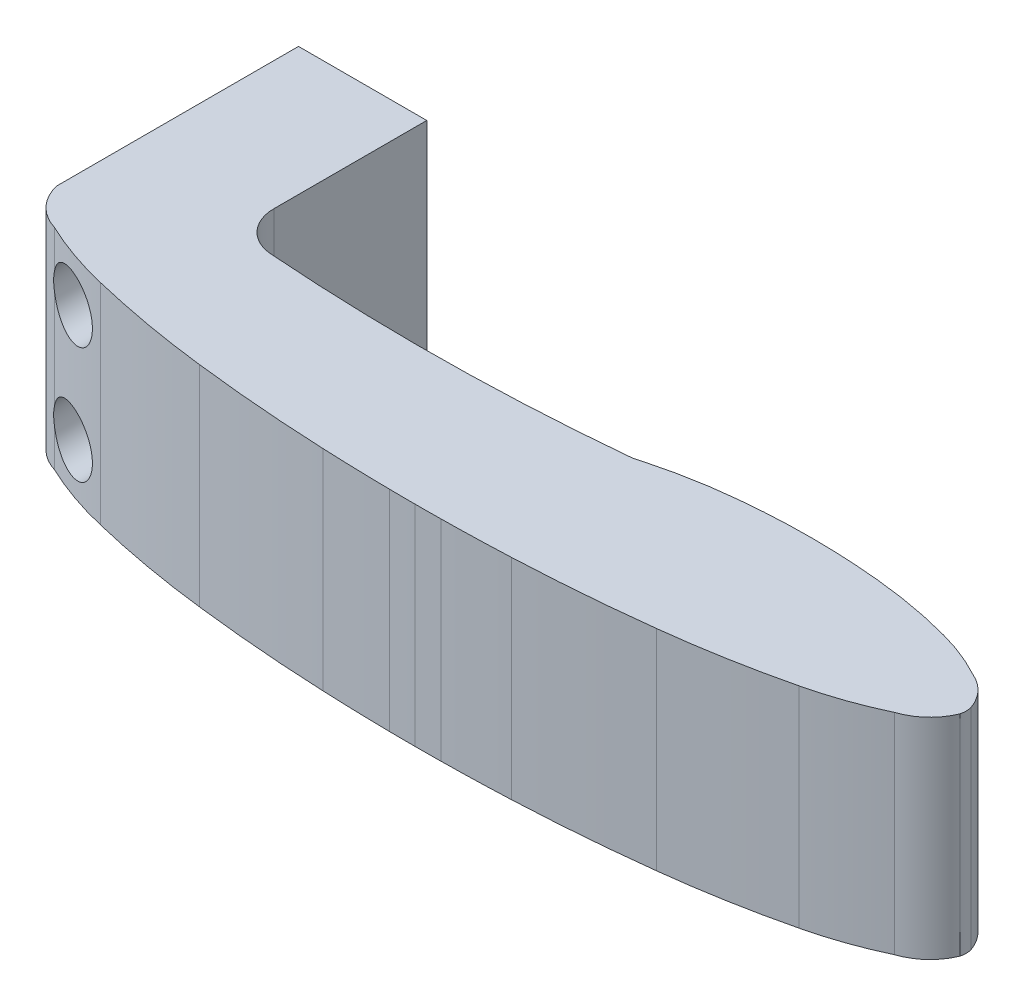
ISO-10303-21;
HEADER;
FILE_DESCRIPTION(('STEP AP214'),'2;1');
FILE_NAME('part.step','',(''),(''),'','','');
FILE_SCHEMA(('AUTOMOTIVE_DESIGN { 1 0 10303 214 1 1 1 1 }'));
ENDSEC;
DATA;
#1=APPLICATION_CONTEXT('core data for automotive mechanical design processes');
#2=APPLICATION_PROTOCOL_DEFINITION('international standard','automotive_design',2000,#1);
#3=PRODUCT_CONTEXT('',#1,'mechanical');
#4=PRODUCT('Part','Part','',(#3));
#5=PRODUCT_RELATED_PRODUCT_CATEGORY('part','',(#4));
#6=PRODUCT_DEFINITION_FORMATION('','',#4);
#7=PRODUCT_DEFINITION_CONTEXT('part definition',#1,'design');
#8=PRODUCT_DEFINITION('design','',#6,#7);
#9=PRODUCT_DEFINITION_SHAPE('','',#8);
#10=(LENGTH_UNIT() NAMED_UNIT(*) SI_UNIT(.MILLI.,.METRE.));
#11=(NAMED_UNIT(*) PLANE_ANGLE_UNIT() SI_UNIT($,.RADIAN.));
#12=(NAMED_UNIT(*) SI_UNIT($,.STERADIAN.) SOLID_ANGLE_UNIT());
#13=UNCERTAINTY_MEASURE_WITH_UNIT(LENGTH_MEASURE(1.E-05),#10,'distance_accuracy_value','');
#14=(GEOMETRIC_REPRESENTATION_CONTEXT(3) GLOBAL_UNCERTAINTY_ASSIGNED_CONTEXT((#13)) GLOBAL_UNIT_ASSIGNED_CONTEXT((#10,
#11,#12)) REPRESENTATION_CONTEXT('',''));
#15=CARTESIAN_POINT('',(0.,0.,0.));
#16=DIRECTION('',(0.,0.,1.));
#17=DIRECTION('',(1.,0.,0.));
#18=AXIS2_PLACEMENT_3D('',#15,#16,#17);
#19=CARTESIAN_POINT('',(125.3991369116,20.8,37.6550717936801));
#20=DIRECTION('',(1.,0.,0.));
#21=DIRECTION('',(0.,0.,1.));
#22=AXIS2_PLACEMENT_3D('',#19,#20,#21);
#23=PLANE('',#22);
#24=DIRECTION('',(0.,0.,1.));
#25=VECTOR('',#24,1.);
#26=CARTESIAN_POINT('',(125.3991369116,-0.799999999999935,40.9856006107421));
#27=LINE('',#26,#25);
#28=CARTESIAN_POINT('',(125.3991369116,-0.799999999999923,37.65507179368));
#29=VERTEX_POINT('',#28);
#30=CARTESIAN_POINT('',(125.3991369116,-0.799999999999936,41.36098902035));
#31=VERTEX_POINT('',#30);
#32=EDGE_CURVE('E429',#29,#31,#27,.T.);
#33=ORIENTED_EDGE('',*,*,#32,.T.);
#34=DIRECTION('',(0.,-1.,0.));
#35=VECTOR('',#34,1.);
#36=CARTESIAN_POINT('',(125.3991369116,10.,41.36098902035));
#37=LINE('',#36,#35);
#38=CARTESIAN_POINT('',(125.3991369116,20.8,41.3609890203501));
#39=VERTEX_POINT('',#38);
#40=EDGE_CURVE('E647',#31,#39,#37,.F.);
#41=ORIENTED_EDGE('',*,*,#40,.T.);
#42=DIRECTION('',(0.,0.,1.));
#43=VECTOR('',#42,1.);
#44=CARTESIAN_POINT('',(125.3991369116,20.8,40.9856006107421));
#45=LINE('',#44,#43);
#46=CARTESIAN_POINT('',(125.3991369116,20.8,37.6550717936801));
#47=VERTEX_POINT('',#46);
#48=EDGE_CURVE('E450',#39,#47,#45,.F.);
#49=ORIENTED_EDGE('',*,*,#48,.T.);
#50=DIRECTION('',(0.,-1.,0.));
#51=VECTOR('',#50,1.);
#52=CARTESIAN_POINT('',(125.3991369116,10.,37.6550717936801));
#53=LINE('',#52,#51);
#54=EDGE_CURVE('E441',#47,#29,#53,.T.);
#55=ORIENTED_EDGE('',*,*,#54,.T.);
#56=EDGE_LOOP('',(#33,#41,#49,#55));
#57=FACE_BOUND('',#56,.T.);
#58=ADVANCED_FACE('F14',(#57),#23,.F.);
#59=CARTESIAN_POINT('',(118.3991369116,20.8,41.3609890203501));
#60=DIRECTION('',(0.,-1.,0.));
#61=DIRECTION('',(1.,0.,0.));
#62=AXIS2_PLACEMENT_3D('',#59,#60,#61);
#63=CYLINDRICAL_SURFACE('',#62,7.);
#64=CARTESIAN_POINT('',(118.3991369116,-0.799999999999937,41.36098902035));
#65=DIRECTION('',(0.,-1.,0.));
#66=DIRECTION('',(1.,0.,0.));
#67=AXIS2_PLACEMENT_3D('',#64,#65,#66);
#68=CIRCLE('',#67,7.);
#69=CARTESIAN_POINT('',(119.769891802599,-0.799999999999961,48.2254650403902));
#70=VERTEX_POINT('',#69);
#71=EDGE_CURVE('E426',#31,#70,#68,.T.);
#72=ORIENTED_EDGE('',*,*,#71,.T.);
#73=DIRECTION('',(0.,-1.,0.));
#74=VECTOR('',#73,1.);
#75=CARTESIAN_POINT('',(119.769891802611,10.,48.2254650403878));
#76=LINE('',#75,#74);
#77=CARTESIAN_POINT('',(119.769891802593,20.8,48.2254650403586));
#78=VERTEX_POINT('',#77);
#79=EDGE_CURVE('E645',#70,#78,#76,.F.);
#80=ORIENTED_EDGE('',*,*,#79,.T.);
#81=CARTESIAN_POINT('',(118.3991369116,20.8,41.3609890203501));
#82=DIRECTION('',(0.,-1.,0.));
#83=DIRECTION('',(1.,0.,0.));
#84=AXIS2_PLACEMENT_3D('',#81,#82,#83);
#85=CIRCLE('',#84,7.);
#86=EDGE_CURVE('E451',#78,#39,#85,.F.);
#87=ORIENTED_EDGE('',*,*,#86,.T.);
#88=ORIENTED_EDGE('',*,*,#40,.F.);
#89=EDGE_LOOP('',(#72,#80,#87,#88));
#90=FACE_BOUND('',#89,.T.);
#91=ADVANCED_FACE('F531',(#90),#63,.F.);
#92=CARTESIAN_POINT('',(71.79347061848,20.8000000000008,-192.0311956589));
#93=DIRECTION('',(0.,-1.,0.));
#94=DIRECTION('',(1.,0.,0.));
#95=AXIS2_PLACEMENT_3D('',#92,#93,#94);
#96=CYLINDRICAL_SURFACE('',#95,245.00000000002);
#97=CARTESIAN_POINT('',(71.79347061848,-0.799999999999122,-192.0311956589));
#98=DIRECTION('',(0.,-1.,0.));
#99=DIRECTION('',(1.,0.,0.));
#100=AXIS2_PLACEMENT_3D('',#97,#98,#99);
#101=CIRCLE('',#100,245.00000000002);
#102=CARTESIAN_POINT('',(23.8170494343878,-0.799999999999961,48.2254650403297));
#103=VERTEX_POINT('',#102);
#104=EDGE_CURVE('E423',#70,#103,#101,.T.);
#105=ORIENTED_EDGE('',*,*,#104,.T.);
#106=DIRECTION('',(0.,-1.,0.));
#107=VECTOR('',#106,1.);
#108=CARTESIAN_POINT('',(23.81704943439,10.,48.2254650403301));
#109=LINE('',#108,#107);
#110=CARTESIAN_POINT('',(23.8170494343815,20.8,48.2254650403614));
#111=VERTEX_POINT('',#110);
#112=EDGE_CURVE('E640',#103,#111,#109,.F.);
#113=ORIENTED_EDGE('',*,*,#112,.T.);
#114=CARTESIAN_POINT('',(71.79347061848,20.8000000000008,-192.0311956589));
#115=DIRECTION('',(0.,-1.,0.));
#116=DIRECTION('',(1.,0.,0.));
#117=AXIS2_PLACEMENT_3D('',#114,#115,#116);
#118=CIRCLE('',#117,245.00000000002);
#119=EDGE_CURVE('E454',#111,#78,#118,.F.);
#120=ORIENTED_EDGE('',*,*,#119,.T.);
#121=ORIENTED_EDGE('',*,*,#79,.F.);
#122=EDGE_LOOP('',(#105,#113,#120,#121));
#123=FACE_BOUND('',#122,.T.);
#124=ADVANCED_FACE('F537',(#123),#96,.F.);
#125=CARTESIAN_POINT('',(25.18780432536,20.8,41.3609890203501));
#126=DIRECTION('',(0.,-1.,0.));
#127=DIRECTION('',(1.,0.,0.));
#128=AXIS2_PLACEMENT_3D('',#125,#126,#127);
#129=CYLINDRICAL_SURFACE('',#128,7.);
#130=CARTESIAN_POINT('',(25.18780432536,-0.799999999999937,41.36098902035));
#131=DIRECTION('',(0.,-1.,0.));
#132=DIRECTION('',(1.,0.,0.));
#133=AXIS2_PLACEMENT_3D('',#130,#131,#132);
#134=CIRCLE('',#133,7.);
#135=CARTESIAN_POINT('',(18.18780432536,-0.799999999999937,41.36098902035));
#136=VERTEX_POINT('',#135);
#137=EDGE_CURVE('E420',#103,#136,#134,.T.);
#138=ORIENTED_EDGE('',*,*,#137,.T.);
#139=DIRECTION('',(0.,1.,0.));
#140=VECTOR('',#139,1.);
#141=CARTESIAN_POINT('',(18.18780432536,10.,41.36098902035));
#142=LINE('',#141,#140);
#143=CARTESIAN_POINT('',(18.18780432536,20.8,41.3609890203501));
#144=VERTEX_POINT('',#143);
#145=EDGE_CURVE('E465',#136,#144,#142,.T.);
#146=ORIENTED_EDGE('',*,*,#145,.T.);
#147=CARTESIAN_POINT('',(25.18780432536,20.8,41.3609890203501));
#148=DIRECTION('',(0.,-1.,0.));
#149=DIRECTION('',(1.,0.,0.));
#150=AXIS2_PLACEMENT_3D('',#147,#148,#149);
#151=CIRCLE('',#150,7.);
#152=EDGE_CURVE('E457',#144,#111,#151,.F.);
#153=ORIENTED_EDGE('',*,*,#152,.T.);
#154=ORIENTED_EDGE('',*,*,#112,.F.);
#155=EDGE_LOOP('',(#138,#146,#153,#154));
#156=FACE_BOUND('',#155,.T.);
#157=ADVANCED_FACE('F549',(#156),#129,.F.);
#158=CARTESIAN_POINT('',(18.18780432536,20.8,41.3609890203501));
#159=DIRECTION('',(-1.,0.,0.));
#160=DIRECTION('',(0.,0.,-1.));
#161=AXIS2_PLACEMENT_3D('',#158,#159,#160);
#162=PLANE('',#161);
#163=ORIENTED_EDGE('',*,*,#145,.F.);
#164=DIRECTION('',(0.,0.,-1.));
#165=VECTOR('',#164,1.);
#166=CARTESIAN_POINT('',(18.18780432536,-0.799999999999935,40.9856006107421));
#167=LINE('',#166,#165);
#168=CARTESIAN_POINT('',(18.1878043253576,-0.799999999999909,33.2605805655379));
#169=VERTEX_POINT('',#168);
#170=EDGE_CURVE('E419',#136,#169,#167,.T.);
#171=ORIENTED_EDGE('',*,*,#170,.T.);
#172=DIRECTION('',(0.,-1.,0.));
#173=VECTOR('',#172,1.);
#174=CARTESIAN_POINT('',(18.1878043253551,10.,33.2605805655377));
#175=LINE('',#174,#173);
#176=CARTESIAN_POINT('',(18.1878043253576,20.8,33.2605805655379));
#177=VERTEX_POINT('',#176);
#178=EDGE_CURVE('E392',#169,#177,#175,.F.);
#179=ORIENTED_EDGE('',*,*,#178,.T.);
#180=DIRECTION('',(0.,0.,-1.));
#181=VECTOR('',#180,1.);
#182=CARTESIAN_POINT('',(18.18780432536,20.8,40.9856006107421));
#183=LINE('',#182,#181);
#184=EDGE_CURVE('E460',#177,#144,#183,.F.);
#185=ORIENTED_EDGE('',*,*,#184,.T.);
#186=EDGE_LOOP('',(#163,#171,#179,#185));
#187=FACE_BOUND('',#186,.T.);
#188=ADVANCED_FACE('F545',(#187),#162,.F.);
#189=CARTESIAN_POINT('',(18.18780432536,20.8,28.7603119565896));
#190=DIRECTION('',(0.,-1.,0.));
#191=DIRECTION('',(1.,0.,0.));
#192=AXIS2_PLACEMENT_3D('',#189,#190,#191);
#193=PLANE('',#192);
#194=DIRECTION('',(-0.961597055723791,0.,0.274465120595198));
#195=VECTOR('',#194,1.);
#196=CARTESIAN_POINT('',(79.7196382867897,20.8,32.2632924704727));
#197=LINE('',#196,#195);
#198=CARTESIAN_POINT('',(79.2402070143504,20.8,32.4001347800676));
#199=VERTEX_POINT('',#198);
#200=CARTESIAN_POINT('',(80.1990695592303,20.8,32.1264501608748));
#201=VERTEX_POINT('',#200);
#202=EDGE_CURVE('E655',#199,#201,#197,.F.);
#203=ORIENTED_EDGE('',*,*,#202,.T.);
#204=CARTESIAN_POINT('',(81.29693004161,20.8,35.9728383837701));
#205=DIRECTION('',(0.,-1.,0.));
#206=DIRECTION('',(1.,0.,0.));
#207=AXIS2_PLACEMENT_3D('',#204,#205,#206);
#208=CIRCLE('',#207,4.);
#209=CARTESIAN_POINT('',(80.2528694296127,20.8,32.1114995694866));
#210=VERTEX_POINT('',#209);
#211=EDGE_CURVE('E447',#210,#201,#208,.F.);
#212=ORIENTED_EDGE('',*,*,#211,.F.);
#213=CARTESIAN_POINT('',(102.0459300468,20.8,112.7106428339));
#214=DIRECTION('',(0.,-1.,0.));
#215=DIRECTION('',(1.,0.,0.));
#216=AXIS2_PLACEMENT_3D('',#213,#214,#215);
#217=CIRCLE('',#216,83.493469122);
#218=CARTESIAN_POINT('',(94.0964714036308,20.8,29.5964713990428));
#219=VERTEX_POINT('',#218);
#220=EDGE_CURVE('E389',#210,#219,#217,.T.);
#221=ORIENTED_EDGE('',*,*,#220,.T.);
#222=CARTESIAN_POINT('',(105.8794650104,20.7999999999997,145.6696240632));
#223=DIRECTION('',(0.,-1.,0.));
#224=DIRECTION('',(1.,0.,0.));
#225=AXIS2_PLACEMENT_3D('',#222,#223,#224);
#226=CIRCLE('',#225,116.6696863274);
#227=CARTESIAN_POINT('',(106.00000000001,20.8,28.9999999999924));
#228=VERTEX_POINT('',#227);
#229=EDGE_CURVE('E385',#219,#228,#226,.T.);
#230=ORIENTED_EDGE('',*,*,#229,.T.);
#231=CARTESIAN_POINT('',(106.1205349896,20.7999999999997,145.6696240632));
#232=DIRECTION('',(0.,-1.,0.));
#233=DIRECTION('',(1.,0.,0.));
#234=AXIS2_PLACEMENT_3D('',#231,#232,#233);
#235=CIRCLE('',#234,116.6696863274);
#236=CARTESIAN_POINT('',(117.903528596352,20.8,29.5964713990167));
#237=VERTEX_POINT('',#236);
#238=EDGE_CURVE('E381',#228,#237,#235,.T.);
#239=ORIENTED_EDGE('',*,*,#238,.T.);
#240=CARTESIAN_POINT('',(109.9540699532,20.8,112.7106428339));
#241=DIRECTION('',(0.,-1.,0.));
#242=DIRECTION('',(1.,0.,0.));
#243=AXIS2_PLACEMENT_3D('',#240,#241,#242);
#244=CIRCLE('',#243,83.493469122);
#245=CARTESIAN_POINT('',(129.151352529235,20.8,31.4541124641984));
#246=VERTEX_POINT('',#245);
#247=EDGE_CURVE('E377',#237,#246,#244,.T.);
#248=ORIENTED_EDGE('',*,*,#247,.T.);
#249=CARTESIAN_POINT('',(132.3991369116,20.8,37.6550717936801));
#250=DIRECTION('',(0.,-1.,0.));
#251=DIRECTION('',(1.,0.,0.));
#252=AXIS2_PLACEMENT_3D('',#249,#250,#251);
#253=CIRCLE('',#252,7.);
#254=EDGE_CURVE('E442',#246,#47,#253,.F.);
#255=ORIENTED_EDGE('',*,*,#254,.T.);
#256=ORIENTED_EDGE('',*,*,#48,.F.);
#257=ORIENTED_EDGE('',*,*,#86,.F.);
#258=ORIENTED_EDGE('',*,*,#119,.F.);
#259=ORIENTED_EDGE('',*,*,#152,.F.);
#260=ORIENTED_EDGE('',*,*,#184,.F.);
#261=CARTESIAN_POINT('',(44.05381368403,20.8000000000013,-325.091095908));
#262=DIRECTION('',(0.,-1.,0.));
#263=DIRECTION('',(1.,0.,0.));
#264=AXIS2_PLACEMENT_3D('',#261,#262,#263);
#265=CIRCLE('',#264,359.28397469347);
#266=CARTESIAN_POINT('',(78.5261356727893,20.8,32.5352922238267));
#267=VERTEX_POINT('',#266);
#268=EDGE_CURVE('E401',#177,#267,#265,.F.);
#269=ORIENTED_EDGE('',*,*,#268,.T.);
#270=CARTESIAN_POINT('',(78.14234653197,20.8,28.5537465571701));
#271=DIRECTION('',(0.,-1.,0.));
#272=DIRECTION('',(1.,0.,0.));
#273=AXIS2_PLACEMENT_3D('',#270,#271,#272);
#274=CIRCLE('',#273,4.);
#275=EDGE_CURVE('E445',#199,#267,#274,.T.);
#276=ORIENTED_EDGE('',*,*,#275,.F.);
#277=EDGE_LOOP('',(#203,#212,#221,#230,#239,#248,#255,#256,#257,#258,#259,#260,#269,#276));
#278=FACE_BOUND('',#277,.T.);
#279=ADVANCED_FACE('F548',(#278),#193,.T.);
#280=CARTESIAN_POINT('',(132.3991369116,20.8,37.6550717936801));
#281=DIRECTION('',(0.,-1.,0.));
#282=DIRECTION('',(1.,0.,0.));
#283=AXIS2_PLACEMENT_3D('',#280,#281,#282);
#284=CYLINDRICAL_SURFACE('',#283,7.);
#285=ORIENTED_EDGE('',*,*,#54,.F.);
#286=ORIENTED_EDGE('',*,*,#254,.F.);
#287=DIRECTION('',(0.,-1.,0.));
#288=VECTOR('',#287,1.);
#289=CARTESIAN_POINT('',(129.151352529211,10.0000000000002,31.4541124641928));
#290=LINE('',#289,#288);
#291=CARTESIAN_POINT('',(129.151352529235,-0.799999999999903,31.4541124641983));
#292=VERTEX_POINT('',#291);
#293=EDGE_CURVE('E376',#246,#292,#290,.T.);
#294=ORIENTED_EDGE('',*,*,#293,.T.);
#295=CARTESIAN_POINT('',(132.3991369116,-0.799999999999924,37.65507179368));
#296=DIRECTION('',(0.,-1.,0.));
#297=DIRECTION('',(1.,0.,0.));
#298=AXIS2_PLACEMENT_3D('',#295,#296,#297);
#299=CIRCLE('',#298,7.);
#300=EDGE_CURVE('E430',#292,#29,#299,.F.);
#301=ORIENTED_EDGE('',*,*,#300,.T.);
#302=EDGE_LOOP('',(#285,#286,#294,#301));
#303=FACE_BOUND('',#302,.T.);
#304=ADVANCED_FACE('F553',(#303),#284,.T.);
#305=CARTESIAN_POINT('',(18.18780432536,-0.799999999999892,28.7603119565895));
#306=DIRECTION('',(0.,-1.,0.));
#307=DIRECTION('',(1.,0.,0.));
#308=AXIS2_PLACEMENT_3D('',#305,#306,#307);
#309=PLANE('',#308);
#310=ORIENTED_EDGE('',*,*,#137,.F.);
#311=ORIENTED_EDGE('',*,*,#104,.F.);
#312=ORIENTED_EDGE('',*,*,#71,.F.);
#313=ORIENTED_EDGE('',*,*,#32,.F.);
#314=ORIENTED_EDGE('',*,*,#300,.F.);
#315=CARTESIAN_POINT('',(109.9540699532,-0.800000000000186,112.7106428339));
#316=DIRECTION('',(0.,-1.,0.));
#317=DIRECTION('',(1.,0.,0.));
#318=AXIS2_PLACEMENT_3D('',#315,#316,#317);
#319=CIRCLE('',#318,83.493469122);
#320=CARTESIAN_POINT('',(117.903528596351,-0.799999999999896,29.5964713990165));
#321=VERTEX_POINT('',#320);
#322=EDGE_CURVE('E373',#292,#321,#319,.F.);
#323=ORIENTED_EDGE('',*,*,#322,.T.);
#324=CARTESIAN_POINT('',(106.1205349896,-0.800000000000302,145.6696240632));
#325=DIRECTION('',(0.,-1.,0.));
#326=DIRECTION('',(0.,0.,-1.));
#327=AXIS2_PLACEMENT_3D('',#324,#325,#326);
#328=CIRCLE('',#327,116.6696863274);
#329=CARTESIAN_POINT('',(106.000000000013,-0.799999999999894,28.9999999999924));
#330=VERTEX_POINT('',#329);
#331=EDGE_CURVE('E416',#321,#330,#328,.F.);
#332=ORIENTED_EDGE('',*,*,#331,.T.);
#333=CARTESIAN_POINT('',(105.8794650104,-0.800000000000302,145.6696240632));
#334=DIRECTION('',(0.,-1.,0.));
#335=DIRECTION('',(0.,0.,-1.));
#336=AXIS2_PLACEMENT_3D('',#333,#334,#335);
#337=CIRCLE('',#336,116.6696863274);
#338=CARTESIAN_POINT('',(94.0964714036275,-0.799999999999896,29.5964713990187));
#339=VERTEX_POINT('',#338);
#340=EDGE_CURVE('E433',#339,#330,#337,.T.);
#341=ORIENTED_EDGE('',*,*,#340,.F.);
#342=CARTESIAN_POINT('',(102.0459300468,-0.800000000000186,112.7106428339));
#343=DIRECTION('',(0.,-1.,0.));
#344=DIRECTION('',(0.,0.,-1.));
#345=AXIS2_PLACEMENT_3D('',#342,#343,#344);
#346=CIRCLE('',#345,83.493469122);
#347=CARTESIAN_POINT('',(80.2528694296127,-0.799999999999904,32.1114995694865));
#348=VERTEX_POINT('',#347);
#349=EDGE_CURVE('E435',#348,#339,#346,.T.);
#350=ORIENTED_EDGE('',*,*,#349,.F.);
#351=CARTESIAN_POINT('',(81.29693004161,-0.799999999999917,35.97283838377));
#352=DIRECTION('',(0.,-1.,0.));
#353=DIRECTION('',(1.,0.,0.));
#354=AXIS2_PLACEMENT_3D('',#351,#352,#353);
#355=CIRCLE('',#354,4.);
#356=CARTESIAN_POINT('',(80.1990695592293,-0.799999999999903,32.1264501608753));
#357=VERTEX_POINT('',#356);
#358=EDGE_CURVE('E473',#348,#357,#355,.F.);
#359=ORIENTED_EDGE('',*,*,#358,.T.);
#360=DIRECTION('',(0.961597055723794,0.,-0.274465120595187));
#361=VECTOR('',#360,1.);
#362=CARTESIAN_POINT('',(79.7196382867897,-0.799999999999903,32.2632924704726));
#363=LINE('',#362,#361);
#364=CARTESIAN_POINT('',(79.2402070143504,-0.799999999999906,32.4001347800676));
#365=VERTEX_POINT('',#364);
#366=EDGE_CURVE('E472',#357,#365,#363,.F.);
#367=ORIENTED_EDGE('',*,*,#366,.T.);
#368=CARTESIAN_POINT('',(78.14234653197,-0.799999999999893,28.55374655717));
#369=DIRECTION('',(0.,-1.,0.));
#370=DIRECTION('',(0.,0.,-1.));
#371=AXIS2_PLACEMENT_3D('',#368,#369,#370);
#372=CIRCLE('',#371,4.);
#373=CARTESIAN_POINT('',(78.5261356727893,-0.799999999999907,32.5352922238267));
#374=VERTEX_POINT('',#373);
#375=EDGE_CURVE('E438',#374,#365,#372,.F.);
#376=ORIENTED_EDGE('',*,*,#375,.F.);
#377=CARTESIAN_POINT('',(44.05381368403,-0.799999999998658,-325.091095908));
#378=DIRECTION('',(0.,-1.,0.));
#379=DIRECTION('',(1.,0.,0.));
#380=AXIS2_PLACEMENT_3D('',#377,#378,#379);
#381=CIRCLE('',#380,359.28397469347);
#382=EDGE_CURVE('E393',#374,#169,#381,.T.);
#383=ORIENTED_EDGE('',*,*,#382,.T.);
#384=ORIENTED_EDGE('',*,*,#170,.F.);
#385=EDGE_LOOP('',(#310,#311,#312,#313,#314,#323,#332,#341,#350,#359,#367,#376,#383,#384));
#386=FACE_BOUND('',#385,.T.);
#387=ADVANCED_FACE('F555',(#386),#309,.F.);
#388=CARTESIAN_POINT('',(78.14234653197,-0.799999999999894,28.55374655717));
#389=DIRECTION('',(0.,-1.,0.));
#390=DIRECTION('',(0.,0.,-1.));
#391=AXIS2_PLACEMENT_3D('',#388,#389,#390);
#392=CYLINDRICAL_SURFACE('',#391,4.);
#393=CARTESIAN_POINT('',(78.14234653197,-7.99999999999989,28.55374655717));
#394=DIRECTION('',(0.,-1.,0.));
#395=DIRECTION('',(0.,0.,-1.));
#396=AXIS2_PLACEMENT_3D('',#393,#394,#395);
#397=CIRCLE('',#396,4.);
#398=CARTESIAN_POINT('',(79.2402070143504,-7.99999999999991,32.4001347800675));
#399=VERTEX_POINT('',#398);
#400=CARTESIAN_POINT('',(78.5261356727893,-7.99999999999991,32.5352922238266));
#401=VERTEX_POINT('',#400);
#402=EDGE_CURVE('E404',#399,#401,#397,.T.);
#403=ORIENTED_EDGE('',*,*,#402,.T.);
#404=DIRECTION('',(0.,-1.,0.));
#405=VECTOR('',#404,1.);
#406=CARTESIAN_POINT('',(78.5261356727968,10.0000000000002,32.5352922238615));
#407=LINE('',#406,#405);
#408=EDGE_CURVE('E396',#401,#374,#407,.F.);
#409=ORIENTED_EDGE('',*,*,#408,.T.);
#410=ORIENTED_EDGE('',*,*,#375,.T.);
#411=DIRECTION('',(0.,-1.,0.));
#412=VECTOR('',#411,1.);
#413=CARTESIAN_POINT('',(79.2402070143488,10.0000000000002,32.4001347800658));
#414=LINE('',#413,#412);
#415=EDGE_CURVE('E468',#399,#365,#414,.F.);
#416=ORIENTED_EDGE('',*,*,#415,.F.);
#417=EDGE_LOOP('',(#403,#409,#410,#416));
#418=FACE_BOUND('',#417,.T.);
#419=ADVANCED_FACE('F558',(#418),#392,.F.);
#420=CARTESIAN_POINT('',(106.1205349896,-0.800000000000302,145.6696240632));
#421=DIRECTION('',(0.,-1.,0.));
#422=DIRECTION('',(0.,0.,-1.));
#423=AXIS2_PLACEMENT_3D('',#420,#421,#422);
#424=CYLINDRICAL_SURFACE('',#423,116.6696863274);
#425=CARTESIAN_POINT('',(106.1205349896,-8.0000000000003,145.6696240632));
#426=DIRECTION('',(0.,-1.,0.));
#427=DIRECTION('',(0.,0.,-1.));
#428=AXIS2_PLACEMENT_3D('',#425,#426,#427);
#429=CIRCLE('',#428,116.6696863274);
#430=CARTESIAN_POINT('',(117.903528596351,-7.9999999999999,29.5964713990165));
#431=VERTEX_POINT('',#430);
#432=CARTESIAN_POINT('',(106.000000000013,-7.99999999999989,28.9999999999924));
#433=VERTEX_POINT('',#432);
#434=EDGE_CURVE('E412',#431,#433,#429,.F.);
#435=ORIENTED_EDGE('',*,*,#434,.T.);
#436=DIRECTION('',(0.,-1.,0.));
#437=VECTOR('',#436,1.);
#438=CARTESIAN_POINT('',(106.,10.0000000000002,28.9999999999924));
#439=LINE('',#438,#437);
#440=EDGE_CURVE('E415',#330,#433,#439,.T.);
#441=ORIENTED_EDGE('',*,*,#440,.F.);
#442=ORIENTED_EDGE('',*,*,#331,.F.);
#443=DIRECTION('',(0.,-1.,0.));
#444=VECTOR('',#443,1.);
#445=CARTESIAN_POINT('',(117.903528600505,10.0000000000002,29.5964713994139));
#446=LINE('',#445,#444);
#447=EDGE_CURVE('E372',#321,#431,#446,.T.);
#448=ORIENTED_EDGE('',*,*,#447,.T.);
#449=EDGE_LOOP('',(#435,#441,#442,#448));
#450=FACE_BOUND('',#449,.T.);
#451=ADVANCED_FACE('F761',(#450),#424,.T.);
#452=CARTESIAN_POINT('',(105.8794650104,-0.800000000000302,145.6696240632));
#453=DIRECTION('',(0.,-1.,0.));
#454=DIRECTION('',(0.,0.,-1.));
#455=AXIS2_PLACEMENT_3D('',#452,#453,#454);
#456=CYLINDRICAL_SURFACE('',#455,116.6696863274);
#457=CARTESIAN_POINT('',(105.8794650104,-8.0000000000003,145.6696240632));
#458=DIRECTION('',(0.,-1.,0.));
#459=DIRECTION('',(0.,0.,-1.));
#460=AXIS2_PLACEMENT_3D('',#457,#458,#459);
#461=CIRCLE('',#460,116.6696863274);
#462=CARTESIAN_POINT('',(94.0964714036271,-7.9999999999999,29.5964713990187));
#463=VERTEX_POINT('',#462);
#464=EDGE_CURVE('E409',#433,#463,#461,.F.);
#465=ORIENTED_EDGE('',*,*,#464,.T.);
#466=DIRECTION('',(0.,1.,0.));
#467=VECTOR('',#466,1.);
#468=CARTESIAN_POINT('',(94.0964713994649,10.0000000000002,29.5964713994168));
#469=LINE('',#468,#467);
#470=EDGE_CURVE('E639',#463,#339,#469,.T.);
#471=ORIENTED_EDGE('',*,*,#470,.T.);
#472=ORIENTED_EDGE('',*,*,#340,.T.);
#473=ORIENTED_EDGE('',*,*,#440,.T.);
#474=EDGE_LOOP('',(#465,#471,#472,#473));
#475=FACE_BOUND('',#474,.T.);
#476=ADVANCED_FACE('F755',(#475),#456,.T.);
#477=CARTESIAN_POINT('',(102.0459300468,-0.800000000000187,112.7106428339));
#478=DIRECTION('',(0.,-1.,0.));
#479=DIRECTION('',(0.,0.,-1.));
#480=AXIS2_PLACEMENT_3D('',#477,#478,#479);
#481=CYLINDRICAL_SURFACE('',#480,83.493469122);
#482=CARTESIAN_POINT('',(102.0459300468,-8.00000000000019,112.7106428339));
#483=DIRECTION('',(0.,-1.,0.));
#484=DIRECTION('',(0.,0.,-1.));
#485=AXIS2_PLACEMENT_3D('',#482,#483,#484);
#486=CIRCLE('',#485,83.493469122);
#487=CARTESIAN_POINT('',(80.2528694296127,-7.9999999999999,32.1114995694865));
#488=VERTEX_POINT('',#487);
#489=EDGE_CURVE('E406',#463,#488,#486,.F.);
#490=ORIENTED_EDGE('',*,*,#489,.T.);
#491=DIRECTION('',(0.,-1.,0.));
#492=VECTOR('',#491,1.);
#493=CARTESIAN_POINT('',(80.2528694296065,10.0000000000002,32.1114995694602));
#494=LINE('',#493,#492);
#495=EDGE_CURVE('E636',#348,#488,#494,.T.);
#496=ORIENTED_EDGE('',*,*,#495,.F.);
#497=ORIENTED_EDGE('',*,*,#349,.T.);
#498=ORIENTED_EDGE('',*,*,#470,.F.);
#499=EDGE_LOOP('',(#490,#496,#497,#498));
#500=FACE_BOUND('',#499,.T.);
#501=ADVANCED_FACE('F752',(#500),#481,.T.);
#502=CARTESIAN_POINT('',(81.29693004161,-0.799999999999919,35.97283838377));
#503=DIRECTION('',(0.,-1.,0.));
#504=DIRECTION('',(0.,0.,-1.));
#505=AXIS2_PLACEMENT_3D('',#502,#503,#504);
#506=CYLINDRICAL_SURFACE('',#505,4.);
#507=CARTESIAN_POINT('',(81.29693004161,-8.,35.97283838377));
#508=DIRECTION('',(0.,-1.,0.));
#509=DIRECTION('',(1.,0.,0.));
#510=AXIS2_PLACEMENT_3D('',#507,#508,#509);
#511=CIRCLE('',#510,4.);
#512=CARTESIAN_POINT('',(80.1990695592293,-7.9999999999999,32.1264501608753));
#513=VERTEX_POINT('',#512);
#514=EDGE_CURVE('E470',#513,#488,#511,.T.);
#515=ORIENTED_EDGE('',*,*,#514,.F.);
#516=DIRECTION('',(0.,-1.,0.));
#517=VECTOR('',#516,1.);
#518=CARTESIAN_POINT('',(80.1990695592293,10.0000000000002,32.1264501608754));
#519=LINE('',#518,#517);
#520=EDGE_CURVE('E657',#513,#357,#519,.F.);
#521=ORIENTED_EDGE('',*,*,#520,.T.);
#522=ORIENTED_EDGE('',*,*,#358,.F.);
#523=ORIENTED_EDGE('',*,*,#495,.T.);
#524=EDGE_LOOP('',(#515,#521,#522,#523));
#525=FACE_BOUND('',#524,.T.);
#526=ADVANCED_FACE('F749',(#525),#506,.T.);
#527=CARTESIAN_POINT('',(79.24020701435,28.,32.4001347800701));
#528=DIRECTION('',(-0.274465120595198,0.,-0.961597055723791));
#529=DIRECTION('',(0.961597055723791,0.,-0.274465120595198));
#530=AXIS2_PLACEMENT_3D('',#527,#528,#529);
#531=PLANE('',#530);
#532=DIRECTION('',(-0.961597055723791,0.,0.274465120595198));
#533=VECTOR('',#532,1.);
#534=CARTESIAN_POINT('',(79.7196382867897,-7.99999999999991,32.2632924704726));
#535=LINE('',#534,#533);
#536=EDGE_CURVE('E659',#399,#513,#535,.F.);
#537=ORIENTED_EDGE('',*,*,#536,.F.);
#538=ORIENTED_EDGE('',*,*,#415,.T.);
#539=ORIENTED_EDGE('',*,*,#366,.F.);
#540=ORIENTED_EDGE('',*,*,#520,.F.);
#541=EDGE_LOOP('',(#537,#538,#539,#540));
#542=FACE_BOUND('',#541,.T.);
#543=ADVANCED_FACE('F743',(#542),#531,.T.);
#544=CARTESIAN_POINT('',(18.,28.,26.2297478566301));
#545=DIRECTION('',(0.,-1.,0.));
#546=DIRECTION('',(1.,0.,0.));
#547=AXIS2_PLACEMENT_3D('',#544,#545,#546);
#548=CYLINDRICAL_SURFACE('',#547,7.);
#549=CARTESIAN_POINT('',(18.,-7.99999999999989,26.22974785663));
#550=DIRECTION('',(0.,-1.,0.));
#551=DIRECTION('',(1.,0.,0.));
#552=AXIS2_PLACEMENT_3D('',#549,#550,#551);
#553=CIRCLE('',#552,7.);
#554=CARTESIAN_POINT('',(11.,-7.99999999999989,26.22974785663));
#555=VERTEX_POINT('',#554);
#556=CARTESIAN_POINT('',(17.3310139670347,-7.99999999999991,33.1977072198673));
#557=VERTEX_POINT('',#556);
#558=EDGE_CURVE('E327',#555,#557,#553,.F.);
#559=ORIENTED_EDGE('',*,*,#558,.F.);
#560=DIRECTION('',(0.,1.,0.));
#561=VECTOR('',#560,1.);
#562=CARTESIAN_POINT('',(11.,10.0000000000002,26.2297478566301));
#563=LINE('',#562,#561);
#564=CARTESIAN_POINT('',(11.,28.,26.2297478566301));
#565=VERTEX_POINT('',#564);
#566=EDGE_CURVE('E590',#565,#555,#563,.F.);
#567=ORIENTED_EDGE('',*,*,#566,.F.);
#568=CARTESIAN_POINT('',(18.,28.,26.2297478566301));
#569=DIRECTION('',(0.,-1.,0.));
#570=DIRECTION('',(1.,0.,0.));
#571=AXIS2_PLACEMENT_3D('',#568,#569,#570);
#572=CIRCLE('',#571,7.);
#573=CARTESIAN_POINT('',(17.3310139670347,28.,33.1977072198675));
#574=VERTEX_POINT('',#573);
#575=EDGE_CURVE('E479',#565,#574,#572,.F.);
#576=ORIENTED_EDGE('',*,*,#575,.T.);
#577=DIRECTION('',(0.,-1.,0.));
#578=VECTOR('',#577,1.);
#579=CARTESIAN_POINT('',(17.3310139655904,10.0000000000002,33.1977072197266));
#580=LINE('',#579,#578);
#581=EDGE_CURVE('E722',#557,#574,#580,.F.);
#582=ORIENTED_EDGE('',*,*,#581,.F.);
#583=EDGE_LOOP('',(#559,#567,#576,#582));
#584=FACE_BOUND('',#583,.T.);
#585=ADVANCED_FACE('F491',(#584),#548,.F.);
#586=CARTESIAN_POINT('',(44.05381368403,28.0000000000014,-325.091095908));
#587=DIRECTION('',(0.,-1.,0.));
#588=DIRECTION('',(1.,0.,0.));
#589=AXIS2_PLACEMENT_3D('',#586,#587,#588);
#590=CYLINDRICAL_SURFACE('',#589,359.28397469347);
#591=ORIENTED_EDGE('',*,*,#382,.F.);
#592=ORIENTED_EDGE('',*,*,#408,.F.);
#593=CARTESIAN_POINT('',(44.05381368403,-7.99999999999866,-325.091095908));
#594=DIRECTION('',(0.,-1.,0.));
#595=DIRECTION('',(1.,0.,0.));
#596=AXIS2_PLACEMENT_3D('',#593,#594,#595);
#597=CIRCLE('',#596,359.28397469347);
#598=EDGE_CURVE('E397',#557,#401,#597,.F.);
#599=ORIENTED_EDGE('',*,*,#598,.F.);
#600=ORIENTED_EDGE('',*,*,#581,.T.);
#601=CARTESIAN_POINT('',(44.05381368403,28.0000000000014,-325.091095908));
#602=DIRECTION('',(0.,-1.,0.));
#603=DIRECTION('',(1.,0.,0.));
#604=AXIS2_PLACEMENT_3D('',#601,#602,#603);
#605=CIRCLE('',#604,359.28397469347);
#606=CARTESIAN_POINT('',(78.5261356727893,28.,32.5352922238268));
#607=VERTEX_POINT('',#606);
#608=EDGE_CURVE('E720',#574,#607,#605,.F.);
#609=ORIENTED_EDGE('',*,*,#608,.T.);
#610=DIRECTION('',(0.,-1.,0.));
#611=VECTOR('',#610,1.);
#612=CARTESIAN_POINT('',(78.5261356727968,10.0000000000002,32.5352922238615));
#613=LINE('',#612,#611);
#614=EDGE_CURVE('E400',#267,#607,#613,.F.);
#615=ORIENTED_EDGE('',*,*,#614,.F.);
#616=ORIENTED_EDGE('',*,*,#268,.F.);
#617=ORIENTED_EDGE('',*,*,#178,.F.);
#618=EDGE_LOOP('',(#591,#592,#599,#600,#609,#615,#616,#617));
#619=FACE_BOUND('',#618,.T.);
#620=ADVANCED_FACE('F738',(#619),#590,.F.);
#621=CARTESIAN_POINT('',(78.14234653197,28.,28.5537465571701));
#622=DIRECTION('',(0.,-1.,0.));
#623=DIRECTION('',(1.,0.,0.));
#624=AXIS2_PLACEMENT_3D('',#621,#622,#623);
#625=CYLINDRICAL_SURFACE('',#624,4.);
#626=CARTESIAN_POINT('',(78.14234653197,28.,28.5537465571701));
#627=DIRECTION('',(0.,-1.,0.));
#628=DIRECTION('',(1.,0.,0.));
#629=AXIS2_PLACEMENT_3D('',#626,#627,#628);
#630=CIRCLE('',#629,4.);
#631=CARTESIAN_POINT('',(79.2402070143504,28.,32.4001347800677));
#632=VERTEX_POINT('',#631);
#633=EDGE_CURVE('E466',#632,#607,#630,.T.);
#634=ORIENTED_EDGE('',*,*,#633,.F.);
#635=DIRECTION('',(0.,-1.,0.));
#636=VECTOR('',#635,1.);
#637=CARTESIAN_POINT('',(79.2402070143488,10.0000000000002,32.4001347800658));
#638=LINE('',#637,#636);
#639=EDGE_CURVE('E469',#199,#632,#638,.F.);
#640=ORIENTED_EDGE('',*,*,#639,.F.);
#641=ORIENTED_EDGE('',*,*,#275,.T.);
#642=ORIENTED_EDGE('',*,*,#614,.T.);
#643=EDGE_LOOP('',(#634,#640,#641,#642));
#644=FACE_BOUND('',#643,.T.);
#645=ADVANCED_FACE('F793',(#644),#625,.F.);
#646=CARTESIAN_POINT('',(79.24020701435,28.,32.4001347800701));
#647=DIRECTION('',(-0.274465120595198,0.,-0.961597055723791));
#648=DIRECTION('',(0.961597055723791,0.,-0.274465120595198));
#649=AXIS2_PLACEMENT_3D('',#646,#647,#648);
#650=PLANE('',#649);
#651=DIRECTION('',(0.961597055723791,0.,-0.274465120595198));
#652=VECTOR('',#651,1.);
#653=CARTESIAN_POINT('',(79.7196382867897,28.,32.2632924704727));
#654=LINE('',#653,#652);
#655=CARTESIAN_POINT('',(80.1990695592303,28.,32.1264501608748));
#656=VERTEX_POINT('',#655);
#657=EDGE_CURVE('E649',#656,#632,#654,.F.);
#658=ORIENTED_EDGE('',*,*,#657,.F.);
#659=DIRECTION('',(0.,-1.,0.));
#660=VECTOR('',#659,1.);
#661=CARTESIAN_POINT('',(80.1990695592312,10.0000000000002,32.1264501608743));
#662=LINE('',#661,#660);
#663=EDGE_CURVE('E464',#656,#201,#662,.T.);
#664=ORIENTED_EDGE('',*,*,#663,.T.);
#665=ORIENTED_EDGE('',*,*,#202,.F.);
#666=ORIENTED_EDGE('',*,*,#639,.T.);
#667=EDGE_LOOP('',(#658,#664,#665,#666));
#668=FACE_BOUND('',#667,.T.);
#669=ADVANCED_FACE('F543',(#668),#650,.T.);
#670=CARTESIAN_POINT('',(81.29693004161,28.,35.9728383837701));
#671=DIRECTION('',(0.,-1.,0.));
#672=DIRECTION('',(1.,0.,0.));
#673=AXIS2_PLACEMENT_3D('',#670,#671,#672);
#674=CYLINDRICAL_SURFACE('',#673,4.);
#675=CARTESIAN_POINT('',(81.29693004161,28.,35.9728383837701));
#676=DIRECTION('',(0.,-1.,0.));
#677=DIRECTION('',(1.,0.,0.));
#678=AXIS2_PLACEMENT_3D('',#675,#676,#677);
#679=CIRCLE('',#678,4.);
#680=CARTESIAN_POINT('',(80.2528694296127,28.,32.1114995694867));
#681=VERTEX_POINT('',#680);
#682=EDGE_CURVE('E461',#681,#656,#679,.F.);
#683=ORIENTED_EDGE('',*,*,#682,.F.);
#684=DIRECTION('',(0.,-1.,0.));
#685=VECTOR('',#684,1.);
#686=CARTESIAN_POINT('',(80.2528694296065,10.0000000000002,32.1114995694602));
#687=LINE('',#686,#685);
#688=EDGE_CURVE('E388',#681,#210,#687,.T.);
#689=ORIENTED_EDGE('',*,*,#688,.T.);
#690=ORIENTED_EDGE('',*,*,#211,.T.);
#691=ORIENTED_EDGE('',*,*,#663,.F.);
#692=EDGE_LOOP('',(#683,#689,#690,#691));
#693=FACE_BOUND('',#692,.T.);
#694=ADVANCED_FACE('F822',(#693),#674,.T.);
#695=CARTESIAN_POINT('',(102.0459300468,28.,112.7106428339));
#696=DIRECTION('',(0.,-1.,0.));
#697=DIRECTION('',(1.,0.,0.));
#698=AXIS2_PLACEMENT_3D('',#695,#696,#697);
#699=CYLINDRICAL_SURFACE('',#698,83.493469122);
#700=CARTESIAN_POINT('',(102.0459300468,28.,112.7106428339));
#701=DIRECTION('',(0.,-1.,0.));
#702=DIRECTION('',(1.,0.,0.));
#703=AXIS2_PLACEMENT_3D('',#700,#701,#702);
#704=CIRCLE('',#703,83.493469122);
#705=CARTESIAN_POINT('',(94.0964714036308,28.,29.5964713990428));
#706=VERTEX_POINT('',#705);
#707=EDGE_CURVE('E718',#681,#706,#704,.T.);
#708=ORIENTED_EDGE('',*,*,#707,.T.);
#709=DIRECTION('',(0.,-1.,0.));
#710=VECTOR('',#709,1.);
#711=CARTESIAN_POINT('',(94.0964713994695,10.0000000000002,29.5964713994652));
#712=LINE('',#711,#710);
#713=EDGE_CURVE('E384',#706,#219,#712,.T.);
#714=ORIENTED_EDGE('',*,*,#713,.T.);
#715=ORIENTED_EDGE('',*,*,#220,.F.);
#716=ORIENTED_EDGE('',*,*,#688,.F.);
#717=EDGE_LOOP('',(#708,#714,#715,#716));
#718=FACE_BOUND('',#717,.T.);
#719=ADVANCED_FACE('F819',(#718),#699,.T.);
#720=CARTESIAN_POINT('',(105.8794650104,28.,145.6696240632));
#721=DIRECTION('',(0.,-1.,0.));
#722=DIRECTION('',(1.,0.,0.));
#723=AXIS2_PLACEMENT_3D('',#720,#721,#722);
#724=CYLINDRICAL_SURFACE('',#723,116.6696863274);
#725=CARTESIAN_POINT('',(105.8794650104,28.,145.6696240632));
#726=DIRECTION('',(0.,-1.,0.));
#727=DIRECTION('',(1.,0.,0.));
#728=AXIS2_PLACEMENT_3D('',#725,#726,#727);
#729=CIRCLE('',#728,116.6696863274);
#730=CARTESIAN_POINT('',(106.00000000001,28.,28.9999999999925));
#731=VERTEX_POINT('',#730);
#732=EDGE_CURVE('E715',#706,#731,#729,.T.);
#733=ORIENTED_EDGE('',*,*,#732,.T.);
#734=DIRECTION('',(0.,-1.,0.));
#735=VECTOR('',#734,1.);
#736=CARTESIAN_POINT('',(106.,10.0000000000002,28.9999999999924));
#737=LINE('',#736,#735);
#738=EDGE_CURVE('E380',#731,#228,#737,.T.);
#739=ORIENTED_EDGE('',*,*,#738,.T.);
#740=ORIENTED_EDGE('',*,*,#229,.F.);
#741=ORIENTED_EDGE('',*,*,#713,.F.);
#742=EDGE_LOOP('',(#733,#739,#740,#741));
#743=FACE_BOUND('',#742,.T.);
#744=ADVANCED_FACE('F815',(#743),#724,.T.);
#745=CARTESIAN_POINT('',(106.1205349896,28.,145.6696240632));
#746=DIRECTION('',(0.,-1.,0.));
#747=DIRECTION('',(1.,0.,0.));
#748=AXIS2_PLACEMENT_3D('',#745,#746,#747);
#749=CYLINDRICAL_SURFACE('',#748,116.6696863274);
#750=CARTESIAN_POINT('',(106.1205349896,28.,145.6696240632));
#751=DIRECTION('',(0.,-1.,0.));
#752=DIRECTION('',(1.,0.,0.));
#753=AXIS2_PLACEMENT_3D('',#750,#751,#752);
#754=CIRCLE('',#753,116.6696863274);
#755=CARTESIAN_POINT('',(117.903528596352,28.,29.5964713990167));
#756=VERTEX_POINT('',#755);
#757=EDGE_CURVE('E712',#731,#756,#754,.T.);
#758=ORIENTED_EDGE('',*,*,#757,.T.);
#759=DIRECTION('',(0.,-1.,0.));
#760=VECTOR('',#759,1.);
#761=CARTESIAN_POINT('',(117.903528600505,10.0000000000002,29.5964713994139));
#762=LINE('',#761,#760);
#763=EDGE_CURVE('E371',#756,#237,#762,.T.);
#764=ORIENTED_EDGE('',*,*,#763,.T.);
#765=ORIENTED_EDGE('',*,*,#238,.F.);
#766=ORIENTED_EDGE('',*,*,#738,.F.);
#767=EDGE_LOOP('',(#758,#764,#765,#766));
#768=FACE_BOUND('',#767,.T.);
#769=ADVANCED_FACE('F813',(#768),#749,.T.);
#770=CARTESIAN_POINT('',(109.9540699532,28.,112.7106428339));
#771=DIRECTION('',(0.,-1.,0.));
#772=DIRECTION('',(1.,0.,0.));
#773=AXIS2_PLACEMENT_3D('',#770,#771,#772);
#774=CYLINDRICAL_SURFACE('',#773,83.493469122);
#775=CARTESIAN_POINT('',(109.9540699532,28.,112.7106428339));
#776=DIRECTION('',(0.,-1.,0.));
#777=DIRECTION('',(1.,0.,0.));
#778=AXIS2_PLACEMENT_3D('',#775,#776,#777);
#779=CIRCLE('',#778,83.493469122);
#780=CARTESIAN_POINT('',(131.774412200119,28.,32.1188811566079));
#781=VERTEX_POINT('',#780);
#782=EDGE_CURVE('E709',#756,#781,#779,.T.);
#783=ORIENTED_EDGE('',*,*,#782,.T.);
#784=DIRECTION('',(0.,-1.,0.));
#785=VECTOR('',#784,1.);
#786=CARTESIAN_POINT('',(131.774412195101,10.0000000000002,32.1188811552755));
#787=LINE('',#786,#785);
#788=CARTESIAN_POINT('',(131.77441220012,-7.99999999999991,32.1188811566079));
#789=VERTEX_POINT('',#788);
#790=EDGE_CURVE('E368',#781,#789,#787,.T.);
#791=ORIENTED_EDGE('',*,*,#790,.T.);
#792=CARTESIAN_POINT('',(109.9540699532,-8.00000000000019,112.7106428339));
#793=DIRECTION('',(0.,-1.,0.));
#794=DIRECTION('',(1.,0.,0.));
#795=AXIS2_PLACEMENT_3D('',#792,#793,#794);
#796=CIRCLE('',#795,83.493469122);
#797=EDGE_CURVE('E369',#431,#789,#796,.T.);
#798=ORIENTED_EDGE('',*,*,#797,.F.);
#799=ORIENTED_EDGE('',*,*,#447,.F.);
#800=ORIENTED_EDGE('',*,*,#322,.F.);
#801=ORIENTED_EDGE('',*,*,#293,.F.);
#802=ORIENTED_EDGE('',*,*,#247,.F.);
#803=ORIENTED_EDGE('',*,*,#763,.F.);
#804=EDGE_LOOP('',(#783,#791,#798,#799,#800,#801,#802,#803));
#805=FACE_BOUND('',#804,.T.);
#806=ADVANCED_FACE('F764',(#805),#774,.T.);
#807=CARTESIAN_POINT('',(122.1399707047,28.,68.4030702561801));
#808=DIRECTION('',(0.,-1.,0.));
#809=DIRECTION('',(1.,0.,0.));
#810=AXIS2_PLACEMENT_3D('',#807,#808,#809);
#811=CYLINDRICAL_SURFACE('',#810,37.5415082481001);
#812=CARTESIAN_POINT('',(122.1399707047,-8.,68.40307025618));
#813=DIRECTION('',(0.,-1.,0.));
#814=DIRECTION('',(1.,0.,0.));
#815=AXIS2_PLACEMENT_3D('',#812,#813,#814);
#816=CIRCLE('',#815,37.5415082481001);
#817=CARTESIAN_POINT('',(140.170397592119,-8.,35.4748369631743));
#818=VERTEX_POINT('',#817);
#819=EDGE_CURVE('E366',#789,#818,#816,.T.);
#820=ORIENTED_EDGE('',*,*,#819,.F.);
#821=ORIENTED_EDGE('',*,*,#790,.F.);
#822=CARTESIAN_POINT('',(122.1399707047,28.,68.4030702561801));
#823=DIRECTION('',(0.,-1.,0.));
#824=DIRECTION('',(1.,0.,0.));
#825=AXIS2_PLACEMENT_3D('',#822,#823,#824);
#826=CIRCLE('',#825,37.5415082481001);
#827=CARTESIAN_POINT('',(140.170397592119,28.,35.4748369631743));
#828=VERTEX_POINT('',#827);
#829=EDGE_CURVE('E706',#781,#828,#826,.T.);
#830=ORIENTED_EDGE('',*,*,#829,.T.);
#831=DIRECTION('',(0.,-1.,0.));
#832=VECTOR('',#831,1.);
#833=CARTESIAN_POINT('',(140.170397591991,10.,35.4748369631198));
#834=LINE('',#833,#832);
#835=EDGE_CURVE('E365',#828,#818,#834,.T.);
#836=ORIENTED_EDGE('',*,*,#835,.T.);
#837=EDGE_LOOP('',(#820,#821,#830,#836));
#838=FACE_BOUND('',#837,.T.);
#839=ADVANCED_FACE('F771',(#838),#811,.T.);
#840=CARTESIAN_POINT('',(136.8012687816,28.,43.3415865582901));
#841=DIRECTION('',(0.,-1.,0.));
#842=DIRECTION('',(1.,0.,0.));
#843=AXIS2_PLACEMENT_3D('',#840,#841,#842);
#844=CYLINDRICAL_SURFACE('',#843,8.55784891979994);
#845=CARTESIAN_POINT('',(136.8012687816,-8.,43.3415865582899));
#846=DIRECTION('',(0.,-1.,0.));
#847=DIRECTION('',(1.,0.,0.));
#848=AXIS2_PLACEMENT_3D('',#845,#846,#847);
#849=CIRCLE('',#848,8.55784891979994);
#850=CARTESIAN_POINT('',(144.885458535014,-8.,40.5339800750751));
#851=VERTEX_POINT('',#850);
#852=EDGE_CURVE('E363',#818,#851,#849,.T.);
#853=ORIENTED_EDGE('',*,*,#852,.F.);
#854=ORIENTED_EDGE('',*,*,#835,.F.);
#855=CARTESIAN_POINT('',(136.8012687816,28.,43.3415865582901));
#856=DIRECTION('',(0.,-1.,0.));
#857=DIRECTION('',(1.,0.,0.));
#858=AXIS2_PLACEMENT_3D('',#855,#856,#857);
#859=CIRCLE('',#858,8.55784891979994);
#860=CARTESIAN_POINT('',(144.885458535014,28.,40.5339800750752));
#861=VERTEX_POINT('',#860);
#862=EDGE_CURVE('E703',#828,#861,#859,.T.);
#863=ORIENTED_EDGE('',*,*,#862,.T.);
#864=DIRECTION('',(0.,-1.,0.));
#865=VECTOR('',#864,1.);
#866=CARTESIAN_POINT('',(144.885458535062,10.,40.5339800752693));
#867=LINE('',#866,#865);
#868=EDGE_CURVE('E362',#861,#851,#867,.T.);
#869=ORIENTED_EDGE('',*,*,#868,.T.);
#870=EDGE_LOOP('',(#853,#854,#863,#869));
#871=FACE_BOUND('',#870,.T.);
#872=ADVANCED_FACE('F917',(#871),#844,.T.);
#873=CARTESIAN_POINT('',(141.0342557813,28.,41.4804196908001));
#874=DIRECTION('',(0.,-1.,0.));
#875=DIRECTION('',(1.,0.,0.));
#876=AXIS2_PLACEMENT_3D('',#873,#874,#875);
#877=CYLINDRICAL_SURFACE('',#876,3.96579255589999);
#878=CARTESIAN_POINT('',(141.0342557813,-8.,41.4804196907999));
#879=DIRECTION('',(0.,-1.,0.));
#880=DIRECTION('',(1.,0.,0.));
#881=AXIS2_PLACEMENT_3D('',#878,#879,#880);
#882=CIRCLE('',#881,3.96579255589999);
#883=CARTESIAN_POINT('',(144.885458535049,-8.,42.4268593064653));
#884=VERTEX_POINT('',#883);
#885=EDGE_CURVE('E360',#851,#884,#882,.T.);
#886=ORIENTED_EDGE('',*,*,#885,.F.);
#887=ORIENTED_EDGE('',*,*,#868,.F.);
#888=CARTESIAN_POINT('',(141.0342557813,28.,41.4804196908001));
#889=DIRECTION('',(0.,-1.,0.));
#890=DIRECTION('',(1.,0.,0.));
#891=AXIS2_PLACEMENT_3D('',#888,#889,#890);
#892=CIRCLE('',#891,3.96579255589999);
#893=CARTESIAN_POINT('',(144.885458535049,28.,42.4268593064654));
#894=VERTEX_POINT('',#893);
#895=EDGE_CURVE('E700',#861,#894,#892,.T.);
#896=ORIENTED_EDGE('',*,*,#895,.T.);
#897=DIRECTION('',(0.,-1.,0.));
#898=VECTOR('',#897,1.);
#899=CARTESIAN_POINT('',(144.885458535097,10.,42.426859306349));
#900=LINE('',#899,#898);
#901=EDGE_CURVE('E359',#894,#884,#900,.T.);
#902=ORIENTED_EDGE('',*,*,#901,.T.);
#903=EDGE_LOOP('',(#886,#887,#896,#902));
#904=FACE_BOUND('',#903,.T.);
#905=ADVANCED_FACE('F926',(#904),#877,.T.);
#906=CARTESIAN_POINT('',(136.0989265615,28.,38.7656860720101));
#907=DIRECTION('',(0.,-1.,0.));
#908=DIRECTION('',(1.,0.,0.));
#909=AXIS2_PLACEMENT_3D('',#906,#907,#908);
#910=CYLINDRICAL_SURFACE('',#909,9.51878845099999);
#911=CARTESIAN_POINT('',(136.0989265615,-8.,38.76568607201));
#912=DIRECTION('',(0.,-1.,0.));
#913=DIRECTION('',(1.,0.,0.));
#914=AXIS2_PLACEMENT_3D('',#911,#912,#913);
#915=CIRCLE('',#914,9.51878845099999);
#916=CARTESIAN_POINT('',(139.078667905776,-8.,47.8060663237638));
#917=VERTEX_POINT('',#916);
#918=EDGE_CURVE('E357',#884,#917,#915,.T.);
#919=ORIENTED_EDGE('',*,*,#918,.F.);
#920=ORIENTED_EDGE('',*,*,#901,.F.);
#921=CARTESIAN_POINT('',(136.0989265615,28.,38.7656860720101));
#922=DIRECTION('',(0.,-1.,0.));
#923=DIRECTION('',(1.,0.,0.));
#924=AXIS2_PLACEMENT_3D('',#921,#922,#923);
#925=CIRCLE('',#924,9.51878845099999);
#926=CARTESIAN_POINT('',(139.078667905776,28.,47.806066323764));
#927=VERTEX_POINT('',#926);
#928=EDGE_CURVE('E697',#894,#927,#925,.T.);
#929=ORIENTED_EDGE('',*,*,#928,.T.);
#930=DIRECTION('',(0.,-1.,0.));
#931=VECTOR('',#930,1.);
#932=CARTESIAN_POINT('',(139.0786679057,10.,47.8060663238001));
#933=LINE('',#932,#931);
#934=EDGE_CURVE('E356',#927,#917,#933,.T.);
#935=ORIENTED_EDGE('',*,*,#934,.T.);
#936=EDGE_LOOP('',(#919,#920,#929,#935));
#937=FACE_BOUND('',#936,.T.);
#938=ADVANCED_FACE('F935',(#937),#910,.T.);
#939=CARTESIAN_POINT('',(112.9793587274,28.,-7.2402293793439));
#940=DIRECTION('',(0.,-1.,0.));
#941=DIRECTION('',(1.,0.,0.));
#942=AXIS2_PLACEMENT_3D('',#939,#940,#941);
#943=CYLINDRICAL_SURFACE('',#942,60.9201822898);
#944=CARTESIAN_POINT('',(112.9793587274,-7.99999999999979,-7.24022937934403));
#945=DIRECTION('',(0.,-1.,0.));
#946=DIRECTION('',(1.,0.,0.));
#947=AXIS2_PLACEMENT_3D('',#944,#945,#946);
#948=CIRCLE('',#947,60.9201822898);
#949=CARTESIAN_POINT('',(126.915000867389,-8.,52.0646312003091));
#950=VERTEX_POINT('',#949);
#951=EDGE_CURVE('E354',#917,#950,#948,.T.);
#952=ORIENTED_EDGE('',*,*,#951,.F.);
#953=ORIENTED_EDGE('',*,*,#934,.F.);
#954=CARTESIAN_POINT('',(112.9793587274,28.,-7.2402293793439));
#955=DIRECTION('',(0.,-1.,0.));
#956=DIRECTION('',(1.,0.,0.));
#957=AXIS2_PLACEMENT_3D('',#954,#955,#956);
#958=CIRCLE('',#957,60.9201822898);
#959=CARTESIAN_POINT('',(126.91500086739,28.,52.0646312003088));
#960=VERTEX_POINT('',#959);
#961=EDGE_CURVE('E694',#927,#960,#958,.T.);
#962=ORIENTED_EDGE('',*,*,#961,.T.);
#963=DIRECTION('',(0.,-1.,0.));
#964=VECTOR('',#963,1.);
#965=CARTESIAN_POINT('',(126.915000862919,10.,52.0646312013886));
#966=LINE('',#965,#964);
#967=EDGE_CURVE('E353',#960,#950,#966,.T.);
#968=ORIENTED_EDGE('',*,*,#967,.T.);
#969=EDGE_LOOP('',(#952,#953,#962,#968));
#970=FACE_BOUND('',#969,.T.);
#971=ADVANCED_FACE('F945',(#970),#943,.T.);
#972=CARTESIAN_POINT('',(85.86301224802,28.0000000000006,-117.9184388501));
#973=DIRECTION('',(0.,-1.,0.));
#974=DIRECTION('',(1.,0.,0.));
#975=AXIS2_PLACEMENT_3D('',#972,#973,#974);
#976=CYLINDRICAL_SURFACE('',#975,174.86997990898);
#977=CARTESIAN_POINT('',(85.86301224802,-7.99999999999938,-117.9184388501));
#978=DIRECTION('',(0.,-1.,0.));
#979=DIRECTION('',(1.,0.,0.));
#980=AXIS2_PLACEMENT_3D('',#977,#978,#979);
#981=CIRCLE('',#980,174.86997990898);
#982=CARTESIAN_POINT('',(106.194405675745,-8.,55.7655970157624));
#983=VERTEX_POINT('',#982);
#984=EDGE_CURVE('E351',#950,#983,#981,.T.);
#985=ORIENTED_EDGE('',*,*,#984,.F.);
#986=ORIENTED_EDGE('',*,*,#967,.F.);
#987=CARTESIAN_POINT('',(85.86301224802,28.0000000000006,-117.9184388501));
#988=DIRECTION('',(0.,-1.,0.));
#989=DIRECTION('',(1.,0.,0.));
#990=AXIS2_PLACEMENT_3D('',#987,#988,#989);
#991=CIRCLE('',#990,174.86997990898);
#992=CARTESIAN_POINT('',(106.194405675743,28.,55.7655970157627));
#993=VERTEX_POINT('',#992);
#994=EDGE_CURVE('E691',#960,#993,#991,.T.);
#995=ORIENTED_EDGE('',*,*,#994,.T.);
#996=DIRECTION('',(0.,-1.,0.));
#997=VECTOR('',#996,1.);
#998=CARTESIAN_POINT('',(106.194405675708,10.,55.7655970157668));
#999=LINE('',#998,#997);
#1000=EDGE_CURVE('E350',#993,#983,#999,.T.);
#1001=ORIENTED_EDGE('',*,*,#1000,.T.);
#1002=EDGE_LOOP('',(#985,#986,#995,#1001));
#1003=FACE_BOUND('',#1002,.T.);
#1004=ADVANCED_FACE('F955',(#1003),#976,.T.);
#1005=CARTESIAN_POINT('',(70.14134948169,28.0000000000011,-244.4896518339));
#1006=DIRECTION('',(0.,-1.,0.));
#1007=DIRECTION('',(1.,0.,0.));
#1008=AXIS2_PLACEMENT_3D('',#1005,#1006,#1007);
#1009=CYLINDRICAL_SURFACE('',#1008,302.41203237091);
#1010=CARTESIAN_POINT('',(70.14134948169,-7.99999999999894,-244.4896518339));
#1011=DIRECTION('',(0.,-1.,0.));
#1012=DIRECTION('',(1.,0.,0.));
#1013=AXIS2_PLACEMENT_3D('',#1010,#1011,#1012);
#1014=CIRCLE('',#1013,302.41203237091);
#1015=CARTESIAN_POINT('',(83.1427700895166,-8.,57.6427701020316));
#1016=VERTEX_POINT('',#1015);
#1017=EDGE_CURVE('E348',#983,#1016,#1014,.T.);
#1018=ORIENTED_EDGE('',*,*,#1017,.F.);
#1019=ORIENTED_EDGE('',*,*,#1000,.F.);
#1020=CARTESIAN_POINT('',(70.14134948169,28.0000000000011,-244.4896518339));
#1021=DIRECTION('',(0.,-1.,0.));
#1022=DIRECTION('',(1.,0.,0.));
#1023=AXIS2_PLACEMENT_3D('',#1020,#1021,#1022);
#1024=CIRCLE('',#1023,302.41203237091);
#1025=CARTESIAN_POINT('',(83.1427700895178,28.,57.6427701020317));
#1026=VERTEX_POINT('',#1025);
#1027=EDGE_CURVE('E688',#993,#1026,#1024,.T.);
#1028=ORIENTED_EDGE('',*,*,#1027,.T.);
#1029=DIRECTION('',(0.,-1.,0.));
#1030=VECTOR('',#1029,1.);
#1031=CARTESIAN_POINT('',(83.1427701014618,10.,57.6427701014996));
#1032=LINE('',#1031,#1030);
#1033=EDGE_CURVE('E347',#1026,#1016,#1032,.T.);
#1034=ORIENTED_EDGE('',*,*,#1033,.T.);
#1035=EDGE_LOOP('',(#1018,#1019,#1028,#1034));
#1036=FACE_BOUND('',#1035,.T.);
#1037=ADVANCED_FACE('F965',(#1036),#1009,.T.);
#1038=CARTESIAN_POINT('',(67.14387516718,28.0000000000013,-301.5307740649));
#1039=DIRECTION('',(0.,-1.,0.));
#1040=DIRECTION('',(1.,0.,0.));
#1041=AXIS2_PLACEMENT_3D('',#1038,#1039,#1040);
#1042=CYLINDRICAL_SURFACE('',#1041,359.52969205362);
#1043=CARTESIAN_POINT('',(67.14387516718,-7.99999999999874,-301.5307740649));
#1044=DIRECTION('',(0.,-1.,0.));
#1045=DIRECTION('',(1.,0.,0.));
#1046=AXIS2_PLACEMENT_3D('',#1043,#1044,#1045);
#1047=CIRCLE('',#1046,359.52969205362);
#1048=CARTESIAN_POINT('',(71.4140766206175,-8.,57.9735581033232));
#1049=VERTEX_POINT('',#1048);
#1050=EDGE_CURVE('E345',#1016,#1049,#1047,.T.);
#1051=ORIENTED_EDGE('',*,*,#1050,.F.);
#1052=ORIENTED_EDGE('',*,*,#1033,.F.);
#1053=CARTESIAN_POINT('',(67.14387516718,28.0000000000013,-301.5307740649));
#1054=DIRECTION('',(0.,-1.,0.));
#1055=DIRECTION('',(1.,0.,0.));
#1056=AXIS2_PLACEMENT_3D('',#1053,#1054,#1055);
#1057=CIRCLE('',#1056,359.52969205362);
#1058=CARTESIAN_POINT('',(71.4140766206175,28.,57.9735581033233));
#1059=VERTEX_POINT('',#1058);
#1060=EDGE_CURVE('E685',#1026,#1059,#1057,.T.);
#1061=ORIENTED_EDGE('',*,*,#1060,.T.);
#1062=DIRECTION('',(0.,-1.,0.));
#1063=VECTOR('',#1062,1.);
#1064=CARTESIAN_POINT('',(71.4140765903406,10.,57.9735581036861));
#1065=LINE('',#1064,#1063);
#1066=EDGE_CURVE('E344',#1059,#1049,#1065,.T.);
#1067=ORIENTED_EDGE('',*,*,#1066,.T.);
#1068=EDGE_LOOP('',(#1051,#1052,#1061,#1067));
#1069=FACE_BOUND('',#1068,.T.);
#1070=ADVANCED_FACE('F975',(#1069),#1042,.T.);
#1071=CARTESIAN_POINT('',(67.00123957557,28.0000000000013,-310.2381152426));
#1072=DIRECTION('',(0.,-1.,0.));
#1073=DIRECTION('',(1.,0.,0.));
#1074=AXIS2_PLACEMENT_3D('',#1071,#1072,#1073);
#1075=CYLINDRICAL_SURFACE('',#1074,368.23811524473);
#1076=CARTESIAN_POINT('',(67.00123957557,-7.99999999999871,-310.2381152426));
#1077=DIRECTION('',(0.,-1.,0.));
#1078=DIRECTION('',(1.,0.,0.));
#1079=AXIS2_PLACEMENT_3D('',#1076,#1077,#1078);
#1080=CIRCLE('',#1079,368.23811524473);
#1081=CARTESIAN_POINT('',(66.9999964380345,-8.,57.9999999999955));
#1082=VERTEX_POINT('',#1081);
#1083=EDGE_CURVE('E342',#1049,#1082,#1080,.T.);
#1084=ORIENTED_EDGE('',*,*,#1083,.F.);
#1085=ORIENTED_EDGE('',*,*,#1066,.F.);
#1086=CARTESIAN_POINT('',(67.00123957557,28.0000000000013,-310.2381152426));
#1087=DIRECTION('',(0.,-1.,0.));
#1088=DIRECTION('',(1.,0.,0.));
#1089=AXIS2_PLACEMENT_3D('',#1086,#1087,#1088);
#1090=CIRCLE('',#1089,368.23811524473);
#1091=CARTESIAN_POINT('',(66.9999964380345,28.,57.9999999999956));
#1092=VERTEX_POINT('',#1091);
#1093=EDGE_CURVE('E682',#1059,#1092,#1090,.T.);
#1094=ORIENTED_EDGE('',*,*,#1093,.T.);
#1095=DIRECTION('',(0.,-1.,0.));
#1096=VECTOR('',#1095,1.);
#1097=CARTESIAN_POINT('',(67.,10.,57.9999999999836));
#1098=LINE('',#1097,#1096);
#1099=EDGE_CURVE('E341',#1092,#1082,#1098,.T.);
#1100=ORIENTED_EDGE('',*,*,#1099,.T.);
#1101=EDGE_LOOP('',(#1084,#1085,#1094,#1100));
#1102=FACE_BOUND('',#1101,.T.);
#1103=ADVANCED_FACE('F985',(#1102),#1075,.T.);
#1104=CARTESIAN_POINT('',(66.99876042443,28.0000000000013,-310.2381152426));
#1105=DIRECTION('',(0.,-1.,0.));
#1106=DIRECTION('',(1.,0.,0.));
#1107=AXIS2_PLACEMENT_3D('',#1104,#1105,#1106);
#1108=CYLINDRICAL_SURFACE('',#1107,368.23811524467);
#1109=CARTESIAN_POINT('',(66.99876042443,-7.99999999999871,-310.2381152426));
#1110=DIRECTION('',(0.,-1.,0.));
#1111=DIRECTION('',(1.,0.,0.));
#1112=AXIS2_PLACEMENT_3D('',#1109,#1110,#1111);
#1113=CIRCLE('',#1112,368.23811524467);
#1114=CARTESIAN_POINT('',(62.5859234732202,-8.,57.9735581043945));
#1115=VERTEX_POINT('',#1114);
#1116=EDGE_CURVE('E339',#1082,#1115,#1113,.T.);
#1117=ORIENTED_EDGE('',*,*,#1116,.F.);
#1118=ORIENTED_EDGE('',*,*,#1099,.F.);
#1119=CARTESIAN_POINT('',(66.99876042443,28.0000000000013,-310.2381152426));
#1120=DIRECTION('',(0.,-1.,0.));
#1121=DIRECTION('',(1.,0.,0.));
#1122=AXIS2_PLACEMENT_3D('',#1119,#1120,#1121);
#1123=CIRCLE('',#1122,368.23811524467);
#1124=CARTESIAN_POINT('',(62.5859234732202,28.,57.9735581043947));
#1125=VERTEX_POINT('',#1124);
#1126=EDGE_CURVE('E679',#1092,#1125,#1123,.T.);
#1127=ORIENTED_EDGE('',*,*,#1126,.T.);
#1128=DIRECTION('',(0.,-1.,0.));
#1129=VECTOR('',#1128,1.);
#1130=CARTESIAN_POINT('',(62.58592340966,10.,57.9735581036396));
#1131=LINE('',#1130,#1129);
#1132=EDGE_CURVE('E338',#1125,#1115,#1131,.T.);
#1133=ORIENTED_EDGE('',*,*,#1132,.T.);
#1134=EDGE_LOOP('',(#1117,#1118,#1127,#1133));
#1135=FACE_BOUND('',#1134,.T.);
#1136=ADVANCED_FACE('F995',(#1135),#1108,.T.);
#1137=CARTESIAN_POINT('',(66.85612483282,28.0000000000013,-301.5307740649));
#1138=DIRECTION('',(0.,-1.,0.));
#1139=DIRECTION('',(1.,0.,0.));
#1140=AXIS2_PLACEMENT_3D('',#1137,#1138,#1139);
#1141=CYLINDRICAL_SURFACE('',#1140,359.52969205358);
#1142=CARTESIAN_POINT('',(66.85612483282,-7.99999999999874,-301.5307740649));
#1143=DIRECTION('',(0.,-1.,0.));
#1144=DIRECTION('',(1.,0.,0.));
#1145=AXIS2_PLACEMENT_3D('',#1142,#1143,#1144);
#1146=CIRCLE('',#1145,359.52969205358);
#1147=CARTESIAN_POINT('',(50.8572299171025,-8.,57.6427701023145));
#1148=VERTEX_POINT('',#1147);
#1149=EDGE_CURVE('E336',#1115,#1148,#1146,.T.);
#1150=ORIENTED_EDGE('',*,*,#1149,.F.);
#1151=ORIENTED_EDGE('',*,*,#1132,.F.);
#1152=CARTESIAN_POINT('',(66.85612483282,28.0000000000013,-301.5307740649));
#1153=DIRECTION('',(0.,-1.,0.));
#1154=DIRECTION('',(1.,0.,0.));
#1155=AXIS2_PLACEMENT_3D('',#1152,#1153,#1154);
#1156=CIRCLE('',#1155,359.52969205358);
#1157=CARTESIAN_POINT('',(50.8572299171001,28.,57.6427701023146));
#1158=VERTEX_POINT('',#1157);
#1159=EDGE_CURVE('E676',#1125,#1158,#1156,.T.);
#1160=ORIENTED_EDGE('',*,*,#1159,.T.);
#1161=DIRECTION('',(0.,-1.,0.));
#1162=VECTOR('',#1161,1.);
#1163=CARTESIAN_POINT('',(50.8572298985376,10.,57.6427701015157));
#1164=LINE('',#1163,#1162);
#1165=EDGE_CURVE('E335',#1158,#1148,#1164,.T.);
#1166=ORIENTED_EDGE('',*,*,#1165,.T.);
#1167=EDGE_LOOP('',(#1150,#1151,#1160,#1166));
#1168=FACE_BOUND('',#1167,.T.);
#1169=ADVANCED_FACE('F579',(#1168),#1141,.T.);
#1170=CARTESIAN_POINT('',(63.85865051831,28.0000000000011,-244.4896518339));
#1171=DIRECTION('',(0.,-1.,0.));
#1172=DIRECTION('',(1.,0.,0.));
#1173=AXIS2_PLACEMENT_3D('',#1170,#1171,#1172);
#1174=CYLINDRICAL_SURFACE('',#1173,302.41203237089);
#1175=CARTESIAN_POINT('',(63.85865051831,-7.99999999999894,-244.4896518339));
#1176=DIRECTION('',(0.,-1.,0.));
#1177=DIRECTION('',(1.,0.,0.));
#1178=AXIS2_PLACEMENT_3D('',#1175,#1176,#1177);
#1179=CIRCLE('',#1178,302.41203237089);
#1180=CARTESIAN_POINT('',(27.8055943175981,-8.,55.7655970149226));
#1181=VERTEX_POINT('',#1180);
#1182=EDGE_CURVE('E333',#1148,#1181,#1179,.T.);
#1183=ORIENTED_EDGE('',*,*,#1182,.F.);
#1184=ORIENTED_EDGE('',*,*,#1165,.F.);
#1185=CARTESIAN_POINT('',(63.85865051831,28.0000000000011,-244.4896518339));
#1186=DIRECTION('',(0.,-1.,0.));
#1187=DIRECTION('',(1.,0.,0.));
#1188=AXIS2_PLACEMENT_3D('',#1185,#1186,#1187);
#1189=CIRCLE('',#1188,302.41203237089);
#1190=CARTESIAN_POINT('',(27.8055943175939,28.,55.7655970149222));
#1191=VERTEX_POINT('',#1190);
#1192=EDGE_CURVE('E673',#1158,#1191,#1189,.T.);
#1193=ORIENTED_EDGE('',*,*,#1192,.T.);
#1194=DIRECTION('',(0.,-1.,0.));
#1195=VECTOR('',#1194,1.);
#1196=CARTESIAN_POINT('',(27.8055943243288,10.,55.7655970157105));
#1197=LINE('',#1196,#1195);
#1198=EDGE_CURVE('E332',#1191,#1181,#1197,.T.);
#1199=ORIENTED_EDGE('',*,*,#1198,.T.);
#1200=EDGE_LOOP('',(#1183,#1184,#1193,#1199));
#1201=FACE_BOUND('',#1200,.T.);
#1202=ADVANCED_FACE('F572',(#1201),#1174,.T.);
#1203=CARTESIAN_POINT('',(11.,28.,0.));
#1204=DIRECTION('',(1.,0.,0.));
#1205=DIRECTION('',(0.,0.,1.));
#1206=AXIS2_PLACEMENT_3D('',#1203,#1204,#1205);
#1207=PLANE('',#1206);
#1208=DIRECTION('',(0.,0.,-1.));
#1209=VECTOR('',#1208,1.);
#1210=CARTESIAN_POINT('',(11.,-7.99999999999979,13.114873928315));
#1211=LINE('',#1210,#1209);
#1212=CARTESIAN_POINT('',(11.,-7.99999999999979,0.));
#1213=VERTEX_POINT('',#1212);
#1214=EDGE_CURVE('E585',#1213,#555,#1211,.F.);
#1215=ORIENTED_EDGE('',*,*,#1214,.F.);
#1216=DIRECTION('',(0.,1.,0.));
#1217=VECTOR('',#1216,1.);
#1218=CARTESIAN_POINT('',(11.,10.0000000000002,0.));
#1219=LINE('',#1218,#1217);
#1220=CARTESIAN_POINT('',(11.,28.,0.));
#1221=VERTEX_POINT('',#1220);
#1222=EDGE_CURVE('E588',#1221,#1213,#1219,.F.);
#1223=ORIENTED_EDGE('',*,*,#1222,.F.);
#1224=DIRECTION('',(0.,0.,1.));
#1225=VECTOR('',#1224,1.);
#1226=CARTESIAN_POINT('',(11.,28.,29.29));
#1227=LINE('',#1226,#1225);
#1228=EDGE_CURVE('E499',#1221,#565,#1227,.T.);
#1229=ORIENTED_EDGE('',*,*,#1228,.T.);
#1230=ORIENTED_EDGE('',*,*,#566,.T.);
#1231=EDGE_LOOP('',(#1215,#1223,#1229,#1230));
#1232=FACE_BOUND('',#1231,.T.);
#1233=ADVANCED_FACE('F570',(#1232),#1207,.T.);
#1234=CARTESIAN_POINT('',(48.13698775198,28.0000000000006,-117.9184388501));
#1235=DIRECTION('',(0.,-1.,0.));
#1236=DIRECTION('',(1.,0.,0.));
#1237=AXIS2_PLACEMENT_3D('',#1234,#1235,#1236);
#1238=CYLINDRICAL_SURFACE('',#1237,174.86997990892);
#1239=CARTESIAN_POINT('',(48.13698775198,-7.99999999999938,-117.9184388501));
#1240=DIRECTION('',(0.,-1.,0.));
#1241=DIRECTION('',(1.,0.,0.));
#1242=AXIS2_PLACEMENT_3D('',#1239,#1240,#1241);
#1243=CIRCLE('',#1242,174.86997990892);
#1244=CARTESIAN_POINT('',(7.08499913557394,-8.,52.0646312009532));
#1245=VERTEX_POINT('',#1244);
#1246=EDGE_CURVE('E330',#1181,#1245,#1243,.T.);
#1247=ORIENTED_EDGE('',*,*,#1246,.F.);
#1248=ORIENTED_EDGE('',*,*,#1198,.F.);
#1249=CARTESIAN_POINT('',(48.13698775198,28.0000000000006,-117.9184388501));
#1250=DIRECTION('',(0.,-1.,0.));
#1251=DIRECTION('',(1.,0.,0.));
#1252=AXIS2_PLACEMENT_3D('',#1249,#1250,#1251);
#1253=CIRCLE('',#1252,174.86997990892);
#1254=CARTESIAN_POINT('',(7.08499913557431,28.,52.0646312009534));
#1255=VERTEX_POINT('',#1254);
#1256=EDGE_CURVE('E670',#1191,#1255,#1253,.T.);
#1257=ORIENTED_EDGE('',*,*,#1256,.T.);
#1258=DIRECTION('',(0.,-1.,0.));
#1259=VECTOR('',#1258,1.);
#1260=CARTESIAN_POINT('',(7.08499913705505,10.,52.0646312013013));
#1261=LINE('',#1260,#1259);
#1262=EDGE_CURVE('E324',#1255,#1245,#1261,.T.);
#1263=ORIENTED_EDGE('',*,*,#1262,.T.);
#1264=EDGE_LOOP('',(#1247,#1248,#1257,#1263));
#1265=FACE_BOUND('',#1264,.T.);
#1266=ADVANCED_FACE('F564',(#1265),#1238,.T.);
#1267=CARTESIAN_POINT('',(-11.,-7.99999999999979,0.));
#1268=DIRECTION('',(0.,-1.,0.));
#1269=DIRECTION('',(1.,0.,0.));
#1270=AXIS2_PLACEMENT_3D('',#1267,#1268,#1269);
#1271=PLANE('',#1270);
#1272=ORIENTED_EDGE('',*,*,#536,.T.);
#1273=ORIENTED_EDGE('',*,*,#514,.T.);
#1274=ORIENTED_EDGE('',*,*,#489,.F.);
#1275=ORIENTED_EDGE('',*,*,#464,.F.);
#1276=ORIENTED_EDGE('',*,*,#434,.F.);
#1277=ORIENTED_EDGE('',*,*,#797,.T.);
#1278=ORIENTED_EDGE('',*,*,#819,.T.);
#1279=ORIENTED_EDGE('',*,*,#852,.T.);
#1280=ORIENTED_EDGE('',*,*,#885,.T.);
#1281=ORIENTED_EDGE('',*,*,#918,.T.);
#1282=ORIENTED_EDGE('',*,*,#951,.T.);
#1283=ORIENTED_EDGE('',*,*,#984,.T.);
#1284=ORIENTED_EDGE('',*,*,#1017,.T.);
#1285=ORIENTED_EDGE('',*,*,#1050,.T.);
#1286=ORIENTED_EDGE('',*,*,#1083,.T.);
#1287=ORIENTED_EDGE('',*,*,#1116,.T.);
#1288=ORIENTED_EDGE('',*,*,#1149,.T.);
#1289=ORIENTED_EDGE('',*,*,#1182,.T.);
#1290=ORIENTED_EDGE('',*,*,#1246,.T.);
#1291=CARTESIAN_POINT('',(21.02064127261,-7.99999999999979,-7.24022937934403));
#1292=DIRECTION('',(0.,-1.,0.));
#1293=DIRECTION('',(1.,0.,0.));
#1294=AXIS2_PLACEMENT_3D('',#1291,#1292,#1293);
#1295=CIRCLE('',#1294,60.92018228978);
#1296=CARTESIAN_POINT('',(-5.07866790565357,-8.,47.8060663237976));
#1297=VERTEX_POINT('',#1296);
#1298=EDGE_CURVE('E319',#1245,#1297,#1295,.T.);
#1299=ORIENTED_EDGE('',*,*,#1298,.T.);
#1300=CARTESIAN_POINT('',(-2.502550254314,-8.,39.45404962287));
#1301=DIRECTION('',(0.,-1.,0.));
#1302=DIRECTION('',(1.,0.,0.));
#1303=AXIS2_PLACEMENT_3D('',#1300,#1301,#1302);
#1304=CIRCLE('',#1303,8.740284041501);
#1305=CARTESIAN_POINT('',(-11.,-8.,41.4999999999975));
#1306=VERTEX_POINT('',#1305);
#1307=EDGE_CURVE('E315',#1297,#1306,#1304,.T.);
#1308=ORIENTED_EDGE('',*,*,#1307,.T.);
#1309=DIRECTION('',(0.,0.,1.));
#1310=VECTOR('',#1309,1.);
#1311=CARTESIAN_POINT('',(-11.,-7.99999999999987,20.75));
#1312=LINE('',#1311,#1310);
#1313=CARTESIAN_POINT('',(-11.,-7.99999999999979,0.));
#1314=VERTEX_POINT('',#1313);
#1315=EDGE_CURVE('E312',#1306,#1314,#1312,.F.);
#1316=ORIENTED_EDGE('',*,*,#1315,.T.);
#1317=DIRECTION('',(-1.,0.,0.));
#1318=VECTOR('',#1317,1.);
#1319=CARTESIAN_POINT('',(0.,-7.99999999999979,0.));
#1320=LINE('',#1319,#1318);
#1321=EDGE_CURVE('E596',#1314,#1213,#1320,.F.);
#1322=ORIENTED_EDGE('',*,*,#1321,.T.);
#1323=ORIENTED_EDGE('',*,*,#1214,.T.);
#1324=ORIENTED_EDGE('',*,*,#558,.T.);
#1325=ORIENTED_EDGE('',*,*,#598,.T.);
#1326=ORIENTED_EDGE('',*,*,#402,.F.);
#1327=EDGE_LOOP('',(#1272,#1273,#1274,#1275,#1276,#1277,#1278,#1279,#1280,#1281,#1282,#1283,
#1284,#1285,#1286,#1287,#1288,#1289,#1290,#1299,#1308,#1316,#1322,#1323,#1324,#1325,#1326));
#1328=FACE_BOUND('',#1327,.T.);
#1329=ADVANCED_FACE('F560',(#1328),#1271,.T.);
#1330=CARTESIAN_POINT('',(-11.,28.,41.5));
#1331=DIRECTION('',(-1.,0.,0.));
#1332=DIRECTION('',(0.,0.,-1.));
#1333=AXIS2_PLACEMENT_3D('',#1330,#1331,#1332);
#1334=PLANE('',#1333);
#1335=ORIENTED_EDGE('',*,*,#1315,.F.);
#1336=DIRECTION('',(0.,1.,0.));
#1337=VECTOR('',#1336,1.);
#1338=CARTESIAN_POINT('',(-11.,10.,41.5));
#1339=LINE('',#1338,#1337);
#1340=CARTESIAN_POINT('',(-11.,28.,41.4999999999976));
#1341=VERTEX_POINT('',#1340);
#1342=EDGE_CURVE('E308',#1341,#1306,#1339,.F.);
#1343=ORIENTED_EDGE('',*,*,#1342,.F.);
#1344=DIRECTION('',(0.,0.,-1.));
#1345=VECTOR('',#1344,1.);
#1346=CARTESIAN_POINT('',(-11.,28.,29.29));
#1347=LINE('',#1346,#1345);
#1348=CARTESIAN_POINT('',(-11.,28.,0.));
#1349=VERTEX_POINT('',#1348);
#1350=EDGE_CURVE('E609',#1341,#1349,#1347,.T.);
#1351=ORIENTED_EDGE('',*,*,#1350,.T.);
#1352=DIRECTION('',(0.,1.,0.));
#1353=VECTOR('',#1352,1.);
#1354=CARTESIAN_POINT('',(-11.,10.0000000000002,0.));
#1355=LINE('',#1354,#1353);
#1356=EDGE_CURVE('E601',#1349,#1314,#1355,.F.);
#1357=ORIENTED_EDGE('',*,*,#1356,.T.);
#1358=EDGE_LOOP('',(#1335,#1343,#1351,#1357));
#1359=FACE_BOUND('',#1358,.T.);
#1360=ADVANCED_FACE('F563',(#1359),#1334,.T.);
#1361=CARTESIAN_POINT('',(-11.,28.,0.));
#1362=DIRECTION('',(0.,-1.,0.));
#1363=DIRECTION('',(1.,0.,0.));
#1364=AXIS2_PLACEMENT_3D('',#1361,#1362,#1363);
#1365=PLANE('',#1364);
#1366=ORIENTED_EDGE('',*,*,#1228,.F.);
#1367=DIRECTION('',(1.,0.,0.));
#1368=VECTOR('',#1367,1.);
#1369=CARTESIAN_POINT('',(67.00037526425,28.,0.));
#1370=LINE('',#1369,#1368);
#1371=EDGE_CURVE('E599',#1349,#1221,#1370,.T.);
#1372=ORIENTED_EDGE('',*,*,#1371,.F.);
#1373=ORIENTED_EDGE('',*,*,#1350,.F.);
#1374=CARTESIAN_POINT('',(-2.502550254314,28.,39.4540496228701));
#1375=DIRECTION('',(0.,-1.,0.));
#1376=DIRECTION('',(1.,0.,0.));
#1377=AXIS2_PLACEMENT_3D('',#1374,#1375,#1376);
#1378=CIRCLE('',#1377,8.740284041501);
#1379=CARTESIAN_POINT('',(-5.07866790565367,28.,47.8060663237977));
#1380=VERTEX_POINT('',#1379);
#1381=EDGE_CURVE('E667',#1380,#1341,#1378,.T.);
#1382=ORIENTED_EDGE('',*,*,#1381,.F.);
#1383=CARTESIAN_POINT('',(21.02064127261,28.,-7.2402293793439));
#1384=DIRECTION('',(0.,-1.,0.));
#1385=DIRECTION('',(1.,0.,0.));
#1386=AXIS2_PLACEMENT_3D('',#1383,#1384,#1385);
#1387=CIRCLE('',#1386,60.92018228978);
#1388=EDGE_CURVE('E307',#1255,#1380,#1387,.T.);
#1389=ORIENTED_EDGE('',*,*,#1388,.F.);
#1390=ORIENTED_EDGE('',*,*,#1256,.F.);
#1391=ORIENTED_EDGE('',*,*,#1192,.F.);
#1392=ORIENTED_EDGE('',*,*,#1159,.F.);
#1393=ORIENTED_EDGE('',*,*,#1126,.F.);
#1394=ORIENTED_EDGE('',*,*,#1093,.F.);
#1395=ORIENTED_EDGE('',*,*,#1060,.F.);
#1396=ORIENTED_EDGE('',*,*,#1027,.F.);
#1397=ORIENTED_EDGE('',*,*,#994,.F.);
#1398=ORIENTED_EDGE('',*,*,#961,.F.);
#1399=ORIENTED_EDGE('',*,*,#928,.F.);
#1400=ORIENTED_EDGE('',*,*,#895,.F.);
#1401=ORIENTED_EDGE('',*,*,#862,.F.);
#1402=ORIENTED_EDGE('',*,*,#829,.F.);
#1403=ORIENTED_EDGE('',*,*,#782,.F.);
#1404=ORIENTED_EDGE('',*,*,#757,.F.);
#1405=ORIENTED_EDGE('',*,*,#732,.F.);
#1406=ORIENTED_EDGE('',*,*,#707,.F.);
#1407=ORIENTED_EDGE('',*,*,#682,.T.);
#1408=ORIENTED_EDGE('',*,*,#657,.T.);
#1409=ORIENTED_EDGE('',*,*,#633,.T.);
#1410=ORIENTED_EDGE('',*,*,#608,.F.);
#1411=ORIENTED_EDGE('',*,*,#575,.F.);
#1412=EDGE_LOOP('',(#1366,#1372,#1373,#1382,#1389,#1390,#1391,#1392,#1393,#1394,#1395,#1396,
#1397,#1398,#1399,#1400,#1401,#1402,#1403,#1404,#1405,#1406,#1407,#1408,#1409,#1410,#1411));
#1413=FACE_BOUND('',#1412,.T.);
#1414=ADVANCED_FACE('F16',(#1413),#1365,.F.);
#1415=CARTESIAN_POINT('',(-2.502550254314,28.,39.4540496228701));
#1416=DIRECTION('',(0.,-1.,0.));
#1417=DIRECTION('',(1.,0.,0.));
#1418=AXIS2_PLACEMENT_3D('',#1415,#1416,#1417);
#1419=CYLINDRICAL_SURFACE('',#1418,8.740284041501);
#1420=DIRECTION('',(0.,-1.,0.));
#1421=VECTOR('',#1420,1.);
#1422=CARTESIAN_POINT('',(-5.07866790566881,10.,47.806066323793));
#1423=LINE('',#1422,#1421);
#1424=CARTESIAN_POINT('',(-5.07866790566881,18.6697247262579,47.806066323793));
#1425=VERTEX_POINT('',#1424);
#1426=CARTESIAN_POINT('',(-5.07866790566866,1.33027527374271,47.806066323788));
#1427=VERTEX_POINT('',#1426);
#1428=EDGE_CURVE('E300',#1425,#1427,#1423,.T.);
#1429=ORIENTED_EDGE('',*,*,#1428,.F.);
#1430=CARTESIAN_POINT('',(0.,25.25,47.8284037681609));
#1431=CARTESIAN_POINT('',(0.147942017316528,25.2499995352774,47.784192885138));
#1432=CARTESIAN_POINT('',(0.294713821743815,25.2437383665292,47.7360517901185));
#1433=CARTESIAN_POINT('',(0.584625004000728,25.219376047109,47.6324130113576));
#1434=CARTESIAN_POINT('',(0.727763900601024,25.2012733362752,47.5769143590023));
#1435=CARTESIAN_POINT('',(1.00944151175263,25.1540208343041,47.4591596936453));
#1436=CARTESIAN_POINT('',(1.14797770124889,25.1248650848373,47.3969000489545));
#1437=CARTESIAN_POINT('',(1.41960746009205,25.056367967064,47.2663473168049));
#1438=CARTESIAN_POINT('',(1.55269856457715,25.0170220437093,47.1980515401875));
#1439=CARTESIAN_POINT('',(1.94058921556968,24.8857591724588,46.986456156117));
#1440=CARTESIAN_POINT('',(2.18662415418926,24.7801489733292,46.8353363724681));
#1441=CARTESIAN_POINT('',(2.65221400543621,24.5384155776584,46.5180781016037));
#1442=CARTESIAN_POINT('',(2.87176687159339,24.4022900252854,46.3519384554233));
#1443=CARTESIAN_POINT('',(3.20013711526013,24.1646623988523,46.0795479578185));
#1444=CARTESIAN_POINT('',(3.31772920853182,24.0715344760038,45.976361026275));
#1445=CARTESIAN_POINT('',(3.54341443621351,23.8767174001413,45.7677231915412));
#1446=CARTESIAN_POINT('',(3.65150891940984,23.7750294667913,45.6622726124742));
#1447=CARTESIAN_POINT('',(3.85834113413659,23.5633730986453,45.4501813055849));
#1448=CARTESIAN_POINT('',(3.957068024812,23.453395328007,45.3435393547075));
#1449=CARTESIAN_POINT('',(4.14502296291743,23.2253861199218,45.1305354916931));
#1450=CARTESIAN_POINT('',(4.23425284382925,23.1073562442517,45.0241735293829));
#1451=CARTESIAN_POINT('',(4.38668631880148,22.88682819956,44.8339025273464));
#1452=CARTESIAN_POINT('',(4.45157409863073,22.7857823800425,44.7496551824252));
#1453=CARTESIAN_POINT('',(4.57503116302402,22.5780220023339,44.5834857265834));
#1454=CARTESIAN_POINT('',(4.63359951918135,22.4713066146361,44.5015639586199));
#1455=CARTESIAN_POINT('',(4.74408316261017,22.2519409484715,44.3416149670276));
#1456=CARTESIAN_POINT('',(4.79600828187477,22.1392997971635,44.2635820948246));
#1457=CARTESIAN_POINT('',(4.89285768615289,21.9074119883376,44.1132873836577));
#1458=CARTESIAN_POINT('',(4.93778587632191,21.7881690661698,44.0410223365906));
#1459=CARTESIAN_POINT('',(5.02762386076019,21.5195782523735,43.8922798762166));
#1460=CARTESIAN_POINT('',(5.0709909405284,21.368743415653,43.8174986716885));
#1461=CARTESIAN_POINT('',(5.14511216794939,21.0563829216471,43.6862518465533));
#1462=CARTESIAN_POINT('',(5.17589209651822,20.8948799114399,43.6297488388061));
#1463=CARTESIAN_POINT('',(5.2182934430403,20.5923380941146,43.5507327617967));
#1464=CARTESIAN_POINT('',(5.23235401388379,20.452792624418,43.5239526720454));
#1465=CARTESIAN_POINT('',(5.24912280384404,20.1706204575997,43.4919319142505));
#1466=CARTESIAN_POINT('',(5.25184488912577,20.0279977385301,43.4866649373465));
#1467=CARTESIAN_POINT('',(5.2456793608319,19.7440009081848,43.4984935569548));
#1468=CARTESIAN_POINT('',(5.23679337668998,19.6026266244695,43.5155860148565));
#1469=CARTESIAN_POINT('',(5.20827982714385,19.3247849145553,43.5694559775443));
#1470=CARTESIAN_POINT('',(5.1886354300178,19.1883255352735,43.6062643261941));
#1471=CARTESIAN_POINT('',(5.12671377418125,18.8497773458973,43.7193608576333));
#1472=CARTESIAN_POINT('',(5.07793639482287,18.6524583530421,43.8062325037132));
#1473=CARTESIAN_POINT('',(4.99131533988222,18.369328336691,43.9526984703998));
#1474=CARTESIAN_POINT('',(4.96011599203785,18.2769049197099,44.004344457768));
#1475=CARTESIAN_POINT('',(4.89353812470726,18.0960438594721,44.1117769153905));
#1476=CARTESIAN_POINT('',(4.85816051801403,18.0076053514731,44.167562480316));
#1477=CARTESIAN_POINT('',(4.75392816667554,17.7658863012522,44.3275559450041));
#1478=CARTESIAN_POINT('',(4.68074466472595,17.6167052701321,44.435132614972));
#1479=CARTESIAN_POINT('',(4.52266864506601,17.3288725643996,44.6557165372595));
#1480=CARTESIAN_POINT('',(4.43776761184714,17.1902286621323,44.768727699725));
#1481=CARTESIAN_POINT('',(4.25654271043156,16.9225845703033,44.9973825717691));
#1482=CARTESIAN_POINT('',(4.16020500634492,16.7935963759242,45.1130293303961));
#1483=CARTESIAN_POINT('',(3.9563411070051,16.5451965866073,45.3446435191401));
#1484=CARTESIAN_POINT('',(3.84881783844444,16.42578250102,45.4606108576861));
#1485=CARTESIAN_POINT('',(3.61640274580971,16.1904137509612,45.6974446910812));
#1486=CARTESIAN_POINT('',(3.49088484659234,16.0749990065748,45.818235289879));
#1487=CARTESIAN_POINT('',(3.2273049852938,15.8555570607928,46.0565414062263));
#1488=CARTESIAN_POINT('',(3.0892406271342,15.7515320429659,46.1740562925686));
#1489=CARTESIAN_POINT('',(2.80094521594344,15.5561891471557,46.4038270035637));
#1490=CARTESIAN_POINT('',(2.65074215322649,15.4648432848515,46.5160940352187));
#1491=CARTESIAN_POINT('',(2.33816221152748,15.2960640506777,46.733906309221));
#1492=CARTESIAN_POINT('',(2.17579068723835,15.2186246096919,46.8394544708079));
#1493=CARTESIAN_POINT('',(1.88734299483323,15.0992461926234,47.0132256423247));
#1494=CARTESIAN_POINT('',(1.76408849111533,15.0534761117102,47.0835224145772));
#1495=CARTESIAN_POINT('',(1.51202416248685,14.9706988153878,47.2191138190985));
#1496=CARTESIAN_POINT('',(1.3832157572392,14.9336893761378,47.2844097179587));
#1497=CARTESIAN_POINT('',(1.12059740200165,14.8692071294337,47.4093309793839));
#1498=CARTESIAN_POINT('',(0.98678908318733,14.8417312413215,47.4689581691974));
#1499=CARTESIAN_POINT('',(0.714851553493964,14.797070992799,47.5819377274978));
#1500=CARTESIAN_POINT('',(0.576722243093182,14.7798868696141,47.6352899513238));
#1501=CARTESIAN_POINT('',(0.296010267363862,14.756445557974,47.7355350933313));
#1502=CARTESIAN_POINT('',(0.15340159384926,14.7502730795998,47.7823754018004));
#1503=CARTESIAN_POINT('',(-0.134077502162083,14.7497447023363,47.8686452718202));
#1504=CARTESIAN_POINT('',(-0.27894793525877,14.7553888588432,47.9080747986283));
#1505=CARTESIAN_POINT('',(-0.569517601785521,14.7789479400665,47.9792071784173));
#1506=CARTESIAN_POINT('',(-0.715216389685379,14.7968567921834,48.0109138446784));
#1507=CARTESIAN_POINT('',(-1.00602027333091,14.8451827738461,48.0665330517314));
#1508=CARTESIAN_POINT('',(-1.15112543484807,14.8755984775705,48.0904464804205));
#1509=CARTESIAN_POINT('',(-1.42203299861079,14.944560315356,48.1282337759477));
#1510=CARTESIAN_POINT('',(-1.54807536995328,14.9817059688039,48.1429643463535));
#1511=CARTESIAN_POINT('',(-1.79753498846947,15.0655611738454,48.1667541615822));
#1512=CARTESIAN_POINT('',(-1.92095134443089,15.1122739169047,48.1758115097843));
#1513=CARTESIAN_POINT('',(-2.16409073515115,15.214958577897,48.1886262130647));
#1514=CARTESIAN_POINT('',(-2.28381517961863,15.2709269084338,48.1923856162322));
#1515=CARTESIAN_POINT('',(-2.51878279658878,15.3917794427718,48.1951087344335));
#1516=CARTESIAN_POINT('',(-2.6340242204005,15.456667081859,48.194070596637));
#1517=CARTESIAN_POINT('',(-2.8580400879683,15.5941859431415,48.1878126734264));
#1518=CARTESIAN_POINT('',(-2.96686884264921,15.6667306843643,48.1826359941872));
#1519=CARTESIAN_POINT('',(-3.17868394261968,15.8196225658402,48.1687894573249));
#1520=CARTESIAN_POINT('',(-3.28166819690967,15.8999724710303,48.1601183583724));
#1521=CARTESIAN_POINT('',(-3.58093775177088,16.1519762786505,48.129865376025));
#1522=CARTESIAN_POINT('',(-3.76767917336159,16.3346700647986,48.1040383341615));
#1523=CARTESIAN_POINT('',(-4.12644383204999,16.7419385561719,48.0442480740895));
#1524=CARTESIAN_POINT('',(-4.29580526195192,16.9687671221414,48.0097749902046));
#1525=CARTESIAN_POINT('',(-4.59608424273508,17.4469423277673,47.9413032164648));
#1526=CARTESIAN_POINT('',(-4.72698814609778,17.6982976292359,47.9073046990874));
#1527=CARTESIAN_POINT('',(-4.89474452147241,18.09574754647,47.8608050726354));
#1528=CARTESIAN_POINT('',(-4.94677976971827,18.2353214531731,47.8457480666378));
#1529=CARTESIAN_POINT('',(-5.03886321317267,18.5186141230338,47.8183786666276));
#1530=CARTESIAN_POINT('',(-5.07891601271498,18.66233127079,47.8060652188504));
#1531=CARTESIAN_POINT('',(-5.14667451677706,18.9528630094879,47.7848618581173));
#1532=CARTESIAN_POINT('',(-5.17438244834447,19.0996770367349,47.7759713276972));
#1533=CARTESIAN_POINT('',(-5.21719822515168,19.3953142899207,47.7621036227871));
#1534=CARTESIAN_POINT('',(-5.23230672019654,19.5441374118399,47.7571262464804));
#1535=CARTESIAN_POINT('',(-5.24943079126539,19.836821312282,47.7514762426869));
#1536=CARTESIAN_POINT('',(-5.25193112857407,19.9806508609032,47.750644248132));
#1537=CARTESIAN_POINT('',(-5.2451243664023,20.2679973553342,47.7528968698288));
#1538=CARTESIAN_POINT('',(-5.23581753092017,20.4115143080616,47.7559813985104));
#1539=CARTESIAN_POINT('',(-5.2054883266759,20.6971479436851,47.7659052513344));
#1540=CARTESIAN_POINT('',(-5.18446780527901,20.8392648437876,47.7727439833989));
#1541=CARTESIAN_POINT('',(-5.13089777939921,21.1211516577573,47.7898244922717));
#1542=CARTESIAN_POINT('',(-5.09834388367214,21.260920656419,47.8000675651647));
#1543=CARTESIAN_POINT('',(-5.02269537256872,21.5345348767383,47.8232173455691));
#1544=CARTESIAN_POINT('',(-4.97980814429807,21.6684419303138,47.8360709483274));
#1545=CARTESIAN_POINT('',(-4.88352229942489,21.9322125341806,47.8639270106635));
#1546=CARTESIAN_POINT('',(-4.83011986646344,22.0620745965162,47.8789302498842));
#1547=CARTESIAN_POINT('',(-4.65468152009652,22.4443764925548,47.926100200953));
#1548=CARTESIAN_POINT('',(-4.51736545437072,22.6897085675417,47.9604436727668));
#1549=CARTESIAN_POINT('',(-4.19766756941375,23.1667734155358,48.0300063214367));
#1550=CARTESIAN_POINT('',(-4.01342111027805,23.3972672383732,48.0651870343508));
#1551=CARTESIAN_POINT('',(-3.7097430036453,23.7178028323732,48.111172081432));
#1552=CARTESIAN_POINT('',(-3.60389722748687,23.8204986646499,48.1253756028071));
#1553=CARTESIAN_POINT('',(-3.38373984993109,24.0167794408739,48.1505044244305));
#1554=CARTESIAN_POINT('',(-3.26943218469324,24.1103685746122,48.1614312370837));
#1555=CARTESIAN_POINT('',(-3.03386412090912,24.2871582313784,48.1789641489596));
#1556=CARTESIAN_POINT('',(-2.91265194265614,24.370420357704,48.1855969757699));
#1557=CARTESIAN_POINT('',(-2.66359256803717,24.526517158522,48.1937373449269));
#1558=CARTESIAN_POINT('',(-2.5357486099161,24.5993568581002,48.1952473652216));
#1559=CARTESIAN_POINT('',(-2.27450495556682,24.7339952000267,48.1923340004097));
#1560=CARTESIAN_POINT('',(-2.14110790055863,24.7957990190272,48.1879134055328));
#1561=CARTESIAN_POINT('',(-1.86992873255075,24.907890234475,48.1724664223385));
#1562=CARTESIAN_POINT('',(-1.73214692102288,24.9581784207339,48.1614404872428));
#1563=CARTESIAN_POINT('',(-1.46232788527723,25.0440920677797,48.1332044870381));
#1564=CARTESIAN_POINT('',(-1.33047528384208,25.0804414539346,48.1164275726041));
#1565=CARTESIAN_POINT('',(-1.06528352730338,25.1425884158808,48.0763931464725));
#1566=CARTESIAN_POINT('',(-0.93194447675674,25.1683867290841,48.0531360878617));
#1567=CARTESIAN_POINT('',(-0.664940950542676,25.2094722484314,48.0000595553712));
#1568=CARTESIAN_POINT('',(-0.531276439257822,25.2247582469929,47.9702393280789));
#1569=CARTESIAN_POINT('',(-0.264764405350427,25.2450229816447,47.9041228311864));
#1570=CARTESIAN_POINT('',(-0.131916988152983,25.250000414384,47.8678257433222));
#1571=CARTESIAN_POINT('',(0.,25.25,47.8284037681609));
#1572=B_SPLINE_CURVE_WITH_KNOTS('',3,(#1430,#1431,#1432,#1433,#1434,#1435,#1436,#1437,#1438,
#1439,#1440,#1441,#1442,#1443,#1444,#1445,#1446,#1447,#1448,#1449,#1450,#1451,#1452,#1453,#1454,
#1455,#1456,#1457,#1458,#1459,#1460,#1461,#1462,#1463,#1464,#1465,#1466,#1467,#1468,#1469,#1470,
#1471,#1472,#1473,#1474,#1475,#1476,#1477,#1478,#1479,#1480,#1481,#1482,#1483,#1484,#1485,#1486,
#1487,#1488,#1489,#1490,#1491,#1492,#1493,#1494,#1495,#1496,#1497,#1498,#1499,#1500,#1501,#1502,
#1503,#1504,#1505,#1506,#1507,#1508,#1509,#1510,#1511,#1512,#1513,#1514,#1515,#1516,#1517,#1518,
#1519,#1520,#1521,#1522,#1523,#1524,#1525,#1526,#1527,#1528,#1529,#1530,#1531,#1532,#1533,#1534,
#1535,#1536,#1537,#1538,#1539,#1540,#1541,#1542,#1543,#1544,#1545,#1546,#1547,#1548,#1549,#1550,
#1551,#1552,#1553,#1554,#1555,#1556,#1557,#1558,#1559,#1560,#1561,#1562,#1563,#1564,#1565,#1566,
#1567,#1568,#1569,#1570,#1571),.UNSPECIFIED.,.T.,.F.,(4,2,2,2,2,2,2,2,2,2,2,2,2,2,2,2,2,2,2,2,2,
2,2,2,2,2,2,2,2,2,2,2,2,2,2,2,2,2,2,2,2,2,2,2,2,2,2,2,2,2,2,2,2,2,2,2,2,2,2,2,2,2,2,2,2,2,2,2,2,
2,4),(0.,0.463060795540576,0.926182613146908,1.38955444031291,1.85313375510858,2.77174659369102,
3.69043037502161,4.23621457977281,4.7819211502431,5.3282517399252,5.87447666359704,
6.31431416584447,6.75421619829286,7.19345945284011,7.63245666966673,8.15271172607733,
8.67189579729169,9.09840064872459,9.52438376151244,9.9503070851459,10.3768986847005,
11.0360135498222,11.3670235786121,11.6979614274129,12.2909145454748,12.8843008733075,
13.4784125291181,14.072369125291,14.698576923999,15.3249045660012,15.9498270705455,
16.574476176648,17.0213535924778,17.4681174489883,17.914736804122,18.3613664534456,
18.8114173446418,19.261470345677,19.7113006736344,20.1610797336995,20.5572694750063,
20.9535915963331,21.3497604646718,21.7460823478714,22.1383291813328,22.5307154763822,
23.3150022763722,24.166986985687,25.0192736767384,25.4679562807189,25.91646625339,
26.3648952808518,26.8133011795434,27.2443277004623,27.6753445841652,28.1062935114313,
28.5374066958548,28.9604987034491,29.3837445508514,30.2296907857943,31.1167174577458,
31.5607387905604,32.0045548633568,32.4455811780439,32.8863941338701,33.3269997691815,
33.767575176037,34.180406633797,34.5932092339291,35.0060592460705,35.4189614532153),.UNSPECIFIED.);
#1573=CARTESIAN_POINT('',(-5.07866790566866,21.3302752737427,47.806066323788));
#1574=VERTEX_POINT('',#1573);
#1575=EDGE_CURVE('E33',#1425,#1574,#1572,.T.);
#1576=ORIENTED_EDGE('',*,*,#1575,.T.);
#1577=EDGE_CURVE('E298',#1380,#1574,#1423,.T.);
#1578=ORIENTED_EDGE('',*,*,#1577,.F.);
#1579=ORIENTED_EDGE('',*,*,#1381,.T.);
#1580=ORIENTED_EDGE('',*,*,#1342,.T.);
#1581=ORIENTED_EDGE('',*,*,#1307,.F.);
#1582=CARTESIAN_POINT('',(-5.07866790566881,-1.33027527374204,47.806066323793));
#1583=VERTEX_POINT('',#1582);
#1584=EDGE_CURVE('E310',#1583,#1297,#1423,.T.);
#1585=ORIENTED_EDGE('',*,*,#1584,.F.);
#1586=CARTESIAN_POINT('',(0.,5.25,47.8284037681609));
#1587=CARTESIAN_POINT('',(0.14794201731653,5.24999953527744,47.784192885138));
#1588=CARTESIAN_POINT('',(0.294713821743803,5.24373836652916,47.7360517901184));
#1589=CARTESIAN_POINT('',(0.584625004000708,5.21937604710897,47.6324130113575));
#1590=CARTESIAN_POINT('',(0.727763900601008,5.20127333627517,47.5769143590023));
#1591=CARTESIAN_POINT('',(1.00944151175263,5.15402083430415,47.4591596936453));
#1592=CARTESIAN_POINT('',(1.14797770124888,5.12486508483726,47.3969000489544));
#1593=CARTESIAN_POINT('',(1.41960746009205,5.05636796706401,47.2663473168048));
#1594=CARTESIAN_POINT('',(1.55269856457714,5.01702204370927,47.1980515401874));
#1595=CARTESIAN_POINT('',(1.94058921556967,4.88575917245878,46.9864561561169));
#1596=CARTESIAN_POINT('',(2.18662415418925,4.78014897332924,46.835336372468));
#1597=CARTESIAN_POINT('',(2.6522140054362,4.53841557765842,46.5180781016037));
#1598=CARTESIAN_POINT('',(2.8717668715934,4.40229002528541,46.3519384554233));
#1599=CARTESIAN_POINT('',(3.20013711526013,4.16466239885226,46.0795479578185));
#1600=CARTESIAN_POINT('',(3.31772920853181,4.07153447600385,45.976361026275));
#1601=CARTESIAN_POINT('',(3.54341443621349,3.87671740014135,45.7677231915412));
#1602=CARTESIAN_POINT('',(3.65150891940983,3.77502946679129,45.6622726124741));
#1603=CARTESIAN_POINT('',(3.85834113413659,3.5633730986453,45.4501813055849));
#1604=CARTESIAN_POINT('',(3.95706802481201,3.45339532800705,45.3435393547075));
#1605=CARTESIAN_POINT('',(4.14502296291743,3.22538611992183,45.130535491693));
#1606=CARTESIAN_POINT('',(4.23425284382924,3.10735624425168,45.0241735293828));
#1607=CARTESIAN_POINT('',(4.38668631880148,2.88682819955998,44.8339025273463));
#1608=CARTESIAN_POINT('',(4.45157409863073,2.7857823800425,44.7496551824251));
#1609=CARTESIAN_POINT('',(4.57503116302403,2.57802200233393,44.5834857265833));
#1610=CARTESIAN_POINT('',(4.63359951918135,2.47130661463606,44.5015639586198));
#1611=CARTESIAN_POINT('',(4.74408316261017,2.2519409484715,44.3416149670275));
#1612=CARTESIAN_POINT('',(4.79600828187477,2.13929979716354,44.2635820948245));
#1613=CARTESIAN_POINT('',(4.89285768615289,1.90741198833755,44.1132873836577));
#1614=CARTESIAN_POINT('',(4.93778587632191,1.78816906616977,44.0410223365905));
#1615=CARTESIAN_POINT('',(5.02762386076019,1.51957825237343,43.8922798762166));
#1616=CARTESIAN_POINT('',(5.0709909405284,1.36874341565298,43.8174986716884));
#1617=CARTESIAN_POINT('',(5.1451121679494,1.05638292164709,43.6862518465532));
#1618=CARTESIAN_POINT('',(5.17589209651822,0.894879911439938,43.629748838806));
#1619=CARTESIAN_POINT('',(5.2182934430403,0.59233809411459,43.5507327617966));
#1620=CARTESIAN_POINT('',(5.23235401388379,0.45279262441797,43.5239526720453));
#1621=CARTESIAN_POINT('',(5.24912280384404,0.170620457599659,43.4919319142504));
#1622=CARTESIAN_POINT('',(5.25184488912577,0.027997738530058,43.4866649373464));
#1623=CARTESIAN_POINT('',(5.2456793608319,-0.25599909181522,43.4984935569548));
#1624=CARTESIAN_POINT('',(5.23679337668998,-0.39737337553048,43.5155860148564));
#1625=CARTESIAN_POINT('',(5.20827982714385,-0.675215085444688,43.5694559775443));
#1626=CARTESIAN_POINT('',(5.1886354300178,-0.811674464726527,43.6062643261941));
#1627=CARTESIAN_POINT('',(5.12671377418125,-1.15022265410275,43.7193608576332));
#1628=CARTESIAN_POINT('',(5.07793639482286,-1.3475416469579,43.8062325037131));
#1629=CARTESIAN_POINT('',(4.99131533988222,-1.630671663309,43.9526984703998));
#1630=CARTESIAN_POINT('',(4.96011599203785,-1.72309508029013,44.004344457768));
#1631=CARTESIAN_POINT('',(4.89353812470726,-1.90395614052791,44.1117769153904));
#1632=CARTESIAN_POINT('',(4.85816051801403,-1.99239464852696,44.1675624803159));
#1633=CARTESIAN_POINT('',(4.75392816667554,-2.23411369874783,44.327555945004));
#1634=CARTESIAN_POINT('',(4.68074466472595,-2.38329472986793,44.4351326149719));
#1635=CARTESIAN_POINT('',(4.52266864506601,-2.67112743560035,44.6557165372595));
#1636=CARTESIAN_POINT('',(4.43776761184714,-2.8097713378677,44.7687276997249));
#1637=CARTESIAN_POINT('',(4.25654271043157,-3.07741542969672,44.9973825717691));
#1638=CARTESIAN_POINT('',(4.16020500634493,-3.20640362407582,45.1130293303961));
#1639=CARTESIAN_POINT('',(3.95634110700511,-3.45480341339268,45.34464351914));
#1640=CARTESIAN_POINT('',(3.84881783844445,-3.57421749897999,45.460610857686));
#1641=CARTESIAN_POINT('',(3.61640274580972,-3.80958624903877,45.6974446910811));
#1642=CARTESIAN_POINT('',(3.49088484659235,-3.92500099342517,45.8182352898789));
#1643=CARTESIAN_POINT('',(3.22730498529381,-4.14444293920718,46.0565414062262));
#1644=CARTESIAN_POINT('',(3.08924062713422,-4.24846795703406,46.1740562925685));
#1645=CARTESIAN_POINT('',(2.80094521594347,-4.4438108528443,46.4038270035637));
#1646=CARTESIAN_POINT('',(2.65074215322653,-4.53515671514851,46.5160940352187));
#1647=CARTESIAN_POINT('',(2.33816221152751,-4.70393594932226,46.7339063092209));
#1648=CARTESIAN_POINT('',(2.17579068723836,-4.78137539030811,46.8394544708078));
#1649=CARTESIAN_POINT('',(1.88734299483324,-4.9007538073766,47.0132256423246));
#1650=CARTESIAN_POINT('',(1.76408849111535,-4.9465238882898,47.0835224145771));
#1651=CARTESIAN_POINT('',(1.51202416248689,-5.02930118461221,47.2191138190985));
#1652=CARTESIAN_POINT('',(1.38321575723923,-5.06631062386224,47.2844097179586));
#1653=CARTESIAN_POINT('',(1.12059740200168,-5.13079287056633,47.4093309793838));
#1654=CARTESIAN_POINT('',(0.986789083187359,-5.15826875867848,47.4689581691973));
#1655=CARTESIAN_POINT('',(0.714851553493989,-5.20292900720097,47.5819377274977));
#1656=CARTESIAN_POINT('',(0.576722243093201,-5.2201131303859,47.6352899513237));
#1657=CARTESIAN_POINT('',(0.296010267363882,-5.243554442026,47.7355350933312));
#1658=CARTESIAN_POINT('',(0.153401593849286,-5.24972692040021,47.7823754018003));
#1659=CARTESIAN_POINT('',(-0.134077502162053,-5.25025529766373,47.8686452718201));
#1660=CARTESIAN_POINT('',(-0.278947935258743,-5.24461114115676,47.9080747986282));
#1661=CARTESIAN_POINT('',(-0.569517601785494,-5.22105205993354,47.9792071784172));
#1662=CARTESIAN_POINT('',(-0.71521638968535,-5.20314320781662,48.0109138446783));
#1663=CARTESIAN_POINT('',(-1.00602027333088,-5.15481722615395,48.0665330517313));
#1664=CARTESIAN_POINT('',(-1.15112543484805,-5.12440152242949,48.0904464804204));
#1665=CARTESIAN_POINT('',(-1.42203299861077,-5.05543968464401,48.1282337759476));
#1666=CARTESIAN_POINT('',(-1.54807536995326,-5.01829403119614,48.1429643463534));
#1667=CARTESIAN_POINT('',(-1.79753498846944,-4.93443882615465,48.1667541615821));
#1668=CARTESIAN_POINT('',(-1.92095134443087,-4.8877260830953,48.1758115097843));
#1669=CARTESIAN_POINT('',(-2.16409073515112,-4.78504142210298,48.1886262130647));
#1670=CARTESIAN_POINT('',(-2.28381517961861,-4.72907309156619,48.1923856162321));
#1671=CARTESIAN_POINT('',(-2.51878279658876,-4.60822055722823,48.1951087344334));
#1672=CARTESIAN_POINT('',(-2.63402422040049,-4.54333291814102,48.1940705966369));
#1673=CARTESIAN_POINT('',(-2.85804008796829,-4.4058140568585,48.1878126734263));
#1674=CARTESIAN_POINT('',(-2.96686884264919,-4.3332693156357,48.1826359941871));
#1675=CARTESIAN_POINT('',(-3.17868394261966,-4.18037743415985,48.1687894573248));
#1676=CARTESIAN_POINT('',(-3.28166819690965,-4.10002752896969,48.1601183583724));
#1677=CARTESIAN_POINT('',(-3.58093775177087,-3.84802372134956,48.129865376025));
#1678=CARTESIAN_POINT('',(-3.76767917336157,-3.66532993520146,48.1040383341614));
#1679=CARTESIAN_POINT('',(-4.12644383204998,-3.25806144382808,48.0442480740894));
#1680=CARTESIAN_POINT('',(-4.29580526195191,-3.03123287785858,48.0097749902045));
#1681=CARTESIAN_POINT('',(-4.59608424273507,-2.55305767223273,47.9413032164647));
#1682=CARTESIAN_POINT('',(-4.72698814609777,-2.30170237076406,47.9073046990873));
#1683=CARTESIAN_POINT('',(-4.8947445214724,-1.90425245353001,47.8608050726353));
#1684=CARTESIAN_POINT('',(-4.94677976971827,-1.76467854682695,47.8457480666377));
#1685=CARTESIAN_POINT('',(-5.03886321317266,-1.48138587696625,47.8183786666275));
#1686=CARTESIAN_POINT('',(-5.07891601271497,-1.33766872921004,47.8060652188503));
#1687=CARTESIAN_POINT('',(-5.14667451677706,-1.04713699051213,47.7848618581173));
#1688=CARTESIAN_POINT('',(-5.17438244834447,-0.90032296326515,47.7759713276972));
#1689=CARTESIAN_POINT('',(-5.21719822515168,-0.604685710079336,47.7621036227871));
#1690=CARTESIAN_POINT('',(-5.23230672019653,-0.455862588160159,47.7571262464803));
#1691=CARTESIAN_POINT('',(-5.24943079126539,-0.163178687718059,47.7514762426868));
#1692=CARTESIAN_POINT('',(-5.25193112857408,-0.0193491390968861,47.7506442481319));
#1693=CARTESIAN_POINT('',(-5.2451243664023,0.267997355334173,47.7528968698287));
#1694=CARTESIAN_POINT('',(-5.23581753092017,0.411514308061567,47.7559813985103));
#1695=CARTESIAN_POINT('',(-5.2054883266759,0.697147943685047,47.7659052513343));
#1696=CARTESIAN_POINT('',(-5.18446780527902,0.839264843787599,47.7727439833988));
#1697=CARTESIAN_POINT('',(-5.13089777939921,1.12115165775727,47.7898244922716));
#1698=CARTESIAN_POINT('',(-5.09834388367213,1.26092065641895,47.8000675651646));
#1699=CARTESIAN_POINT('',(-5.02269537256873,1.5345348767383,47.823217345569));
#1700=CARTESIAN_POINT('',(-4.97980814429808,1.66844193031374,47.8360709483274));
#1701=CARTESIAN_POINT('',(-4.8835222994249,1.93221253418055,47.8639270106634));
#1702=CARTESIAN_POINT('',(-4.83011986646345,2.06207459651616,47.8789302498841));
#1703=CARTESIAN_POINT('',(-4.65468152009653,2.44437649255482,47.9261002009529));
#1704=CARTESIAN_POINT('',(-4.51736545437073,2.68970856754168,47.9604436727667));
#1705=CARTESIAN_POINT('',(-4.19766756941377,3.16677341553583,48.0300063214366));
#1706=CARTESIAN_POINT('',(-4.01342111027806,3.39726723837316,48.0651870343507));
#1707=CARTESIAN_POINT('',(-3.70974300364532,3.71780283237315,48.111172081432));
#1708=CARTESIAN_POINT('',(-3.60389722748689,3.8204986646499,48.125375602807));
#1709=CARTESIAN_POINT('',(-3.38373984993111,4.01677944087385,48.1505044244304));
#1710=CARTESIAN_POINT('',(-3.26943218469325,4.11036857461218,48.1614312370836));
#1711=CARTESIAN_POINT('',(-3.03386412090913,4.28715823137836,48.1789641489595));
#1712=CARTESIAN_POINT('',(-2.91265194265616,4.37042035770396,48.1855969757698));
#1713=CARTESIAN_POINT('',(-2.6635925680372,4.52651715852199,48.1937373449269));
#1714=CARTESIAN_POINT('',(-2.53574860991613,4.59935685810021,48.1952473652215));
#1715=CARTESIAN_POINT('',(-2.27450495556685,4.73399520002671,48.1923340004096));
#1716=CARTESIAN_POINT('',(-2.14110790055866,4.79579901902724,48.1879134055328));
#1717=CARTESIAN_POINT('',(-1.86992873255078,4.90789023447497,48.1724664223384));
#1718=CARTESIAN_POINT('',(-1.73214692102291,4.95817842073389,48.1614404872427));
#1719=CARTESIAN_POINT('',(-1.46232788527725,5.04409206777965,48.133204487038));
#1720=CARTESIAN_POINT('',(-1.33047528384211,5.0804414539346,48.116427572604));
#1721=CARTESIAN_POINT('',(-1.0652835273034,5.14258841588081,48.0763931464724));
#1722=CARTESIAN_POINT('',(-0.93194447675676,5.16838672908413,48.0531360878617));
#1723=CARTESIAN_POINT('',(-0.664940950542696,5.20947224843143,48.0000595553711));
#1724=CARTESIAN_POINT('',(-0.531276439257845,5.22475824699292,47.9702393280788));
#1725=CARTESIAN_POINT('',(-0.26476440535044,5.24502298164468,47.9041228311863));
#1726=CARTESIAN_POINT('',(-0.131916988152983,5.25000041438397,47.8678257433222));
#1727=CARTESIAN_POINT('',(0.,5.25,47.8284037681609));
#1728=B_SPLINE_CURVE_WITH_KNOTS('',3,(#1586,#1587,#1588,#1589,#1590,#1591,#1592,#1593,#1594,
#1595,#1596,#1597,#1598,#1599,#1600,#1601,#1602,#1603,#1604,#1605,#1606,#1607,#1608,#1609,#1610,
#1611,#1612,#1613,#1614,#1615,#1616,#1617,#1618,#1619,#1620,#1621,#1622,#1623,#1624,#1625,#1626,
#1627,#1628,#1629,#1630,#1631,#1632,#1633,#1634,#1635,#1636,#1637,#1638,#1639,#1640,#1641,#1642,
#1643,#1644,#1645,#1646,#1647,#1648,#1649,#1650,#1651,#1652,#1653,#1654,#1655,#1656,#1657,#1658,
#1659,#1660,#1661,#1662,#1663,#1664,#1665,#1666,#1667,#1668,#1669,#1670,#1671,#1672,#1673,#1674,
#1675,#1676,#1677,#1678,#1679,#1680,#1681,#1682,#1683,#1684,#1685,#1686,#1687,#1688,#1689,#1690,
#1691,#1692,#1693,#1694,#1695,#1696,#1697,#1698,#1699,#1700,#1701,#1702,#1703,#1704,#1705,#1706,
#1707,#1708,#1709,#1710,#1711,#1712,#1713,#1714,#1715,#1716,#1717,#1718,#1719,#1720,#1721,#1722,
#1723,#1724,#1725,#1726,#1727),.UNSPECIFIED.,.T.,.F.,(4,2,2,2,2,2,2,2,2,2,2,2,2,2,2,2,2,2,2,2,2,
2,2,2,2,2,2,2,2,2,2,2,2,2,2,2,2,2,2,2,2,2,2,2,2,2,2,2,2,2,2,2,2,2,2,2,2,2,2,2,2,2,2,2,2,2,2,2,2,
2,4),(0.,0.46306079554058,0.926182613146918,1.38955444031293,1.85313375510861,2.77174659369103,
3.69043037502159,4.23621457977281,4.78192115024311,5.32825173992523,5.87447666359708,
6.3143141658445,6.75421619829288,7.19345945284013,7.63245666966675,8.15271172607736,
8.67189579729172,9.09840064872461,9.52438376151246,9.95030708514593,10.3768986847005,
11.0360135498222,11.3670235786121,11.6979614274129,12.2909145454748,12.8843008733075,
13.4784125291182,14.072369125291,14.698576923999,15.3249045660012,15.9498270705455,
16.574476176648,17.0213535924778,17.4681174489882,17.914736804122,18.3613664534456,
18.8114173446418,19.261470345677,19.7113006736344,20.1610797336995,20.5572694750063,
20.9535915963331,21.3497604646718,21.7460823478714,22.1383291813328,22.5307154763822,
23.3150022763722,24.166986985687,25.0192736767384,25.4679562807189,25.9164662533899,
26.3648952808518,26.8133011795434,27.2443277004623,27.6753445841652,28.1062935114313,
28.5374066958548,28.9604987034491,29.3837445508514,30.2296907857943,31.1167174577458,
31.5607387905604,32.0045548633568,32.4455811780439,32.8863941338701,33.3269997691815,
33.767575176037,34.180406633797,34.5932092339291,35.0060592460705,35.4189614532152),.UNSPECIFIED.);
#1729=EDGE_CURVE('E39',#1583,#1427,#1728,.T.);
#1730=ORIENTED_EDGE('',*,*,#1729,.T.);
#1731=EDGE_LOOP('',(#1429,#1576,#1578,#1579,#1580,#1581,#1585,#1730));
#1732=FACE_BOUND('',#1731,.T.);
#1733=ADVANCED_FACE('F296',(#1732),#1419,.T.);
#1734=CARTESIAN_POINT('',(21.02064127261,28.,-7.2402293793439));
#1735=DIRECTION('',(0.,-1.,0.));
#1736=DIRECTION('',(1.,0.,0.));
#1737=AXIS2_PLACEMENT_3D('',#1734,#1735,#1736);
#1738=CYLINDRICAL_SURFACE('',#1737,60.92018228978);
#1739=ORIENTED_EDGE('',*,*,#1577,.T.);
#1740=CARTESIAN_POINT('',(0.,25.25,49.938448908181));
#1741=CARTESIAN_POINT('',(0.30275307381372,25.2499896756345,50.0497468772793));
#1742=CARTESIAN_POINT('',(0.606577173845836,25.2237545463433,50.1586888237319));
#1743=CARTESIAN_POINT('',(1.20785775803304,25.1182871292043,50.3690050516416));
#1744=CARTESIAN_POINT('',(1.50530860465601,25.0390097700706,50.4703728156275));
#1745=CARTESIAN_POINT('',(2.08516503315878,24.8280312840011,50.6632235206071));
#1746=CARTESIAN_POINT('',(2.36754379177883,24.6962400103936,50.7546891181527));
#1747=CARTESIAN_POINT('',(2.90712403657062,24.3827400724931,50.9254757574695));
#1748=CARTESIAN_POINT('',(3.16433471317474,24.2010497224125,51.0048012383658));
#1749=CARTESIAN_POINT('',(3.63449819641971,23.800577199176,51.1468293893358));
#1750=CARTESIAN_POINT('',(3.84882436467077,23.5836014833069,51.2100763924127));
#1751=CARTESIAN_POINT('',(4.23799280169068,23.1136657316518,51.3230056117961));
#1752=CARTESIAN_POINT('',(4.41284420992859,22.8607140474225,51.3726909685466));
#1753=CARTESIAN_POINT('',(4.70959164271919,22.3384544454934,51.455946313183));
#1754=CARTESIAN_POINT('',(4.83352295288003,22.070401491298,51.4901428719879));
#1755=CARTESIAN_POINT('',(5.03495959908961,21.5161082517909,51.5452925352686));
#1756=CARTESIAN_POINT('',(5.11247320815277,21.2298712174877,51.5662479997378));
#1757=CARTESIAN_POINT('',(5.21682387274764,20.6557813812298,51.5943762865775));
#1758=CARTESIAN_POINT('',(5.24498918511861,20.3681869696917,51.6019104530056));
#1759=CARTESIAN_POINT('',(5.25378532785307,19.7922303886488,51.6042682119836));
#1760=CARTESIAN_POINT('',(5.23442001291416,19.5038682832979,51.5990928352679));
#1761=CARTESIAN_POINT('',(5.14924145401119,18.9374201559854,51.5761727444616));
#1762=CARTESIAN_POINT('',(5.0838697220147,18.6592626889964,51.5585475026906));
#1763=CARTESIAN_POINT('',(4.90937767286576,18.1181596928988,51.5109741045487));
#1764=CARTESIAN_POINT('',(4.80025746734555,17.8552141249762,51.481025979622));
#1765=CARTESIAN_POINT('',(4.54106157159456,17.3500218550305,51.40881315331));
#1766=CARTESIAN_POINT('',(4.39072436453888,17.1079207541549,51.3664696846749));
#1767=CARTESIAN_POINT('',(4.05435075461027,16.6526316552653,51.2699759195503));
#1768=CARTESIAN_POINT('',(3.8683116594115,16.4394458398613,51.2158247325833));
#1769=CARTESIAN_POINT('',(3.4617969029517,16.0426056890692,51.095021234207));
#1770=CARTESIAN_POINT('',(3.24063260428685,15.8597357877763,51.0281119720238));
#1771=CARTESIAN_POINT('',(2.77395749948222,15.5335978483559,50.8836621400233));
#1772=CARTESIAN_POINT('',(2.52844273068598,15.3903362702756,50.806119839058));
#1773=CARTESIAN_POINT('',(2.01012511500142,15.1412148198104,50.6384874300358));
#1774=CARTESIAN_POINT('',(1.73662787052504,15.0370532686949,50.5480230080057));
#1775=CARTESIAN_POINT('',(1.17882765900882,14.8758203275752,50.3588836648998));
#1776=CARTESIAN_POINT('',(0.894522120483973,14.8187602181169,50.2602067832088));
#1777=CARTESIAN_POINT('',(0.308166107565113,14.7503362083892,50.0516855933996));
#1778=CARTESIAN_POINT('',(0.00594176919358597,14.7414122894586,49.9415292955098));
#1779=CARTESIAN_POINT('',(-0.594212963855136,14.7750798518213,49.7173810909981));
#1780=CARTESIAN_POINT('',(-0.892142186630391,14.8176851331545,49.6033881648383));
#1781=CARTESIAN_POINT('',(-1.48862635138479,14.9557754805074,49.3699145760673));
#1782=CARTESIAN_POINT('',(-1.78666718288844,15.0534360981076,49.2504070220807));
#1783=CARTESIAN_POINT('',(-2.36200006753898,15.3009141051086,49.0147016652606));
#1784=CARTESIAN_POINT('',(-2.63928824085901,15.4507412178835,48.8985044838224));
#1785=CARTESIAN_POINT('',(-3.03383430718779,15.7124001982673,48.7300450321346));
#1786=CARTESIAN_POINT('',(-3.16211648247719,15.8060896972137,48.6747169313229));
#1787=CARTESIAN_POINT('',(-3.41030746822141,16.0053058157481,48.5667200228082));
#1788=CARTESIAN_POINT('',(-3.53021994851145,16.1108271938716,48.514050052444));
#1789=CARTESIAN_POINT('',(-3.76066187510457,16.3331790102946,48.412008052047));
#1790=CARTESIAN_POINT('',(-3.87118857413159,16.450012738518,48.3626369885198));
#1791=CARTESIAN_POINT('',(-4.08170615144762,16.6942257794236,48.2679148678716));
#1792=CARTESIAN_POINT('',(-4.18170251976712,16.8215995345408,48.2225617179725));
#1793=CARTESIAN_POINT('',(-4.36487740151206,17.078723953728,48.1389510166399));
#1794=CARTESIAN_POINT('',(-4.4486831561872,17.2079449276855,48.1004386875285));
#1795=CARTESIAN_POINT('',(-4.60506893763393,17.4742008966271,48.0281974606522));
#1796=CARTESIAN_POINT('',(-4.67765456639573,17.6112319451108,47.994466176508));
#1797=CARTESIAN_POINT('',(-4.81077135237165,17.8921277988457,47.9323374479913));
#1798=CARTESIAN_POINT('',(-4.87130714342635,18.0359899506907,47.9039379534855));
#1799=CARTESIAN_POINT('',(-4.97957978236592,18.329449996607,47.8529707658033));
#1800=CARTESIAN_POINT('',(-5.02731790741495,18.4790473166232,47.8304024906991));
#1801=CARTESIAN_POINT('',(-5.10547041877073,18.7683503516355,47.7933656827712));
#1802=CARTESIAN_POINT('',(-5.13709394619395,18.9076585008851,47.7783340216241));
#1803=CARTESIAN_POINT('',(-5.18892730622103,19.1888486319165,47.7536607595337));
#1804=CARTESIAN_POINT('',(-5.20913809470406,19.3307303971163,47.7440187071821));
#1805=CARTESIAN_POINT('',(-5.23788939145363,19.6158861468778,47.7302939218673));
#1806=CARTESIAN_POINT('',(-5.24643416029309,19.7591596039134,47.7262091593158));
#1807=CARTESIAN_POINT('',(-5.25175744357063,20.0459736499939,47.7236650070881));
#1808=CARTESIAN_POINT('',(-5.24853635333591,20.1895142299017,47.7252054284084));
#1809=CARTESIAN_POINT('',(-5.2309604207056,20.4664072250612,47.7336016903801));
#1810=CARTESIAN_POINT('',(-5.21733979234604,20.5998176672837,47.740106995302));
#1811=CARTESIAN_POINT('',(-5.1799914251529,20.8649360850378,47.7579149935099));
#1812=CARTESIAN_POINT('',(-5.15626042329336,20.9966434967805,47.7692192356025));
#1813=CARTESIAN_POINT('',(-5.09895719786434,21.2573555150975,47.7964510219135));
#1814=CARTESIAN_POINT('',(-5.06538872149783,21.3863611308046,47.812376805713));
#1815=CARTESIAN_POINT('',(-4.98874073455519,21.6409282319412,47.8486302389));
#1816=CARTESIAN_POINT('',(-4.94565762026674,21.7664883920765,47.8689595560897));
#1817=CARTESIAN_POINT('',(-4.84988759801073,22.0146881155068,47.9139832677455));
#1818=CARTESIAN_POINT('',(-4.79710207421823,22.1372815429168,47.9387223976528));
#1819=CARTESIAN_POINT('',(-4.68273685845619,22.3774337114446,47.9920885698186));
#1820=CARTESIAN_POINT('',(-4.62115401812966,22.4949906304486,48.020717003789));
#1821=CARTESIAN_POINT('',(-4.42400969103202,22.8390838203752,48.1119097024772));
#1822=CARTESIAN_POINT('',(-4.27597909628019,23.0572305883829,48.1798161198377));
#1823=CARTESIAN_POINT('',(-3.93951897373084,23.4815742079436,48.332205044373));
#1824=CARTESIAN_POINT('',(-3.74893059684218,23.6857395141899,48.4175352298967));
#1825=CARTESIAN_POINT('',(-3.34033478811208,24.0597311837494,48.5975830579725));
#1826=CARTESIAN_POINT('',(-3.12231077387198,24.2295366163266,48.6923063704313));
#1827=CARTESIAN_POINT('',(-2.64392879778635,24.5454893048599,48.8964801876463));
#1828=CARTESIAN_POINT('',(-2.38152997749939,24.6881843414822,49.0064910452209));
#1829=CARTESIAN_POINT('',(-1.83773782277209,24.9267924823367,49.2296679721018));
#1830=CARTESIAN_POINT('',(-1.55635776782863,25.0227379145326,49.3428318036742));
#1831=CARTESIAN_POINT('',(-1.06201164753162,25.1458889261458,49.5371842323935));
#1832=CARTESIAN_POINT('',(-0.851923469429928,25.1848150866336,49.6184631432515));
#1833=CARTESIAN_POINT('',(-0.428069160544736,25.2368747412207,49.7797045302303));
#1834=CARTESIAN_POINT('',(-0.214302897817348,25.2500073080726,49.8596669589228));
#1835=CARTESIAN_POINT('',(0.,25.25,49.938448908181));
#1836=B_SPLINE_CURVE_WITH_KNOTS('',3,(#1740,#1741,#1742,#1743,#1744,#1745,#1746,#1747,#1748,
#1749,#1750,#1751,#1752,#1753,#1754,#1755,#1756,#1757,#1758,#1759,#1760,#1761,#1762,#1763,#1764,
#1765,#1766,#1767,#1768,#1769,#1770,#1771,#1772,#1773,#1774,#1775,#1776,#1777,#1778,#1779,#1780,
#1781,#1782,#1783,#1784,#1785,#1786,#1787,#1788,#1789,#1790,#1791,#1792,#1793,#1794,#1795,#1796,
#1797,#1798,#1799,#1800,#1801,#1802,#1803,#1804,#1805,#1806,#1807,#1808,#1809,#1810,#1811,#1812,
#1813,#1814,#1815,#1816,#1817,#1818,#1819,#1820,#1821,#1822,#1823,#1824,#1825,#1826,#1827,#1828,
#1829,#1830,#1831,#1832,#1833,#1834,#1835),.UNSPECIFIED.,.T.,.F.,(4,2,2,2,2,2,2,2,2,2,2,2,2,2,2,
2,2,2,2,2,2,2,2,2,2,2,2,2,2,2,2,2,2,2,2,2,2,2,2,2,2,2,2,2,2,2,2,4),(0.,0.966902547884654,
1.93462774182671,2.90402136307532,3.87305966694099,4.80273561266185,5.73219609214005,
6.6196717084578,7.50698910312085,8.37003387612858,9.23300865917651,10.0878126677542,
10.9426144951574,11.8029707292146,12.6633918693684,13.5434370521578,14.4236256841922,
15.338535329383,16.2536640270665,17.2147720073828,18.176137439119,19.1784607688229,
20.1809710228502,20.6850768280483,21.1889601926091,21.6929905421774,22.1967567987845,
22.672398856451,23.1478026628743,23.6230232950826,24.0981964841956,24.528559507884,
24.9588864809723,25.3890562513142,25.8192115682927,26.2215218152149,26.6239620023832,
27.0262490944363,27.4286888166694,27.8354711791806,28.2423994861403,29.055648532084,
29.9282034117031,30.8012882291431,31.752103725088,32.7022607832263,33.3866553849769,
34.071074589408),.UNSPECIFIED.);
#1837=EDGE_CURVE('E9',#1574,#1425,#1836,.T.);
#1838=ORIENTED_EDGE('',*,*,#1837,.T.);
#1839=ORIENTED_EDGE('',*,*,#1428,.T.);
#1840=CARTESIAN_POINT('',(0.,5.25,49.9384489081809));
#1841=CARTESIAN_POINT('',(0.302753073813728,5.24998967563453,50.0497468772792));
#1842=CARTESIAN_POINT('',(0.606577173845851,5.22375454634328,50.1586888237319));
#1843=CARTESIAN_POINT('',(1.20785775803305,5.11828712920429,50.3690050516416));
#1844=CARTESIAN_POINT('',(1.505308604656,5.03900977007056,50.4703728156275));
#1845=CARTESIAN_POINT('',(2.08516503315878,4.82803128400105,50.6632235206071));
#1846=CARTESIAN_POINT('',(2.36754379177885,4.69624001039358,50.7546891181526));
#1847=CARTESIAN_POINT('',(2.90712403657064,4.38274007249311,50.9254757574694));
#1848=CARTESIAN_POINT('',(3.16433471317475,4.20104972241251,51.0048012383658));
#1849=CARTESIAN_POINT('',(3.63449819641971,3.80057719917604,51.1468293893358));
#1850=CARTESIAN_POINT('',(3.84882436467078,3.5836014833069,51.2100763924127));
#1851=CARTESIAN_POINT('',(4.23799280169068,3.11366573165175,51.323005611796));
#1852=CARTESIAN_POINT('',(4.41284420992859,2.86071404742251,51.3726909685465));
#1853=CARTESIAN_POINT('',(4.70959164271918,2.33845444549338,51.4559463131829));
#1854=CARTESIAN_POINT('',(4.83352295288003,2.07040149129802,51.4901428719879));
#1855=CARTESIAN_POINT('',(5.03495959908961,1.51610825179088,51.5452925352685));
#1856=CARTESIAN_POINT('',(5.11247320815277,1.22987121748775,51.5662479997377));
#1857=CARTESIAN_POINT('',(5.21682387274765,0.655781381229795,51.5943762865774));
#1858=CARTESIAN_POINT('',(5.24498918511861,0.368186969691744,51.6019104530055));
#1859=CARTESIAN_POINT('',(5.25378532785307,-0.207769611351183,51.6042682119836));
#1860=CARTESIAN_POINT('',(5.23442001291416,-0.496131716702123,51.5990928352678));
#1861=CARTESIAN_POINT('',(5.14924145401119,-1.06257984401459,51.5761727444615));
#1862=CARTESIAN_POINT('',(5.08386972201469,-1.34073731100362,51.5585475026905));
#1863=CARTESIAN_POINT('',(4.90937767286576,-1.88184030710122,51.5109741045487));
#1864=CARTESIAN_POINT('',(4.80025746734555,-2.14478587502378,51.4810259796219));
#1865=CARTESIAN_POINT('',(4.54106157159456,-2.64997814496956,51.4088131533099));
#1866=CARTESIAN_POINT('',(4.39072436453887,-2.89207924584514,51.3664696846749));
#1867=CARTESIAN_POINT('',(4.05435075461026,-3.34736834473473,51.2699759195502));
#1868=CARTESIAN_POINT('',(3.8683116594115,-3.56055416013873,51.2158247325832));
#1869=CARTESIAN_POINT('',(3.4617969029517,-3.95739431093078,51.0950212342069));
#1870=CARTESIAN_POINT('',(3.24063260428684,-4.14026421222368,51.0281119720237));
#1871=CARTESIAN_POINT('',(2.77395749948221,-4.46640215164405,50.8836621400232));
#1872=CARTESIAN_POINT('',(2.52844273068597,-4.60966372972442,50.8061198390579));
#1873=CARTESIAN_POINT('',(2.01012511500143,-4.85878518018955,50.6384874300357));
#1874=CARTESIAN_POINT('',(1.73662787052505,-4.96294673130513,50.5480230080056));
#1875=CARTESIAN_POINT('',(1.17882765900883,-5.12417967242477,50.3588836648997));
#1876=CARTESIAN_POINT('',(0.894522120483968,-5.18123978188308,50.2602067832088));
#1877=CARTESIAN_POINT('',(0.308166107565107,-5.24966379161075,50.0516855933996));
#1878=CARTESIAN_POINT('',(0.0059417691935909,-5.2585877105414,49.9415292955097));
#1879=CARTESIAN_POINT('',(-0.594212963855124,-5.22492014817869,49.7173810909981));
#1880=CARTESIAN_POINT('',(-0.892142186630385,-5.18231486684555,49.6033881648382));
#1881=CARTESIAN_POINT('',(-1.48862635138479,-5.04422451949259,49.3699145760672));
#1882=CARTESIAN_POINT('',(-1.78666718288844,-4.94656390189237,49.2504070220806));
#1883=CARTESIAN_POINT('',(-2.36200006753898,-4.69908589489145,49.0147016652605));
#1884=CARTESIAN_POINT('',(-2.63928824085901,-4.54925878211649,48.8985044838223));
#1885=CARTESIAN_POINT('',(-3.03383430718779,-4.28759980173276,48.7300450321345));
#1886=CARTESIAN_POINT('',(-3.16211648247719,-4.19391030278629,48.6747169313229));
#1887=CARTESIAN_POINT('',(-3.41030746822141,-3.99469418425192,48.5667200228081));
#1888=CARTESIAN_POINT('',(-3.53021994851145,-3.88917280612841,48.5140500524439));
#1889=CARTESIAN_POINT('',(-3.76066187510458,-3.66682098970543,48.412008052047));
#1890=CARTESIAN_POINT('',(-3.8711885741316,-3.54998726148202,48.3626369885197));
#1891=CARTESIAN_POINT('',(-4.08170615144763,-3.30577422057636,48.2679148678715));
#1892=CARTESIAN_POINT('',(-4.18170251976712,-3.17840046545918,48.2225617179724));
#1893=CARTESIAN_POINT('',(-4.36487740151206,-2.92127604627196,48.1389510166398));
#1894=CARTESIAN_POINT('',(-4.4486831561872,-2.7920550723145,48.1004386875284));
#1895=CARTESIAN_POINT('',(-4.60506893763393,-2.52579910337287,48.0281974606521));
#1896=CARTESIAN_POINT('',(-4.67765456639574,-2.38876805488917,47.9944661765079));
#1897=CARTESIAN_POINT('',(-4.81077135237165,-2.10787220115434,47.9323374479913));
#1898=CARTESIAN_POINT('',(-4.87130714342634,-1.96401004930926,47.9039379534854));
#1899=CARTESIAN_POINT('',(-4.97957978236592,-1.67055000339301,47.8529707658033));
#1900=CARTESIAN_POINT('',(-5.02731790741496,-1.52095268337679,47.8304024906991));
#1901=CARTESIAN_POINT('',(-5.10547041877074,-1.23164964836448,47.7933656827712));
#1902=CARTESIAN_POINT('',(-5.13709394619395,-1.09234149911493,47.778334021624));
#1903=CARTESIAN_POINT('',(-5.18892730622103,-0.8111513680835,47.7536607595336));
#1904=CARTESIAN_POINT('',(-5.20913809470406,-0.669269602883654,47.744018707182));
#1905=CARTESIAN_POINT('',(-5.23788939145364,-0.384113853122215,47.7302939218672));
#1906=CARTESIAN_POINT('',(-5.24643416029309,-0.240840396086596,47.7262091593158));
#1907=CARTESIAN_POINT('',(-5.25175744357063,0.0459736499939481,47.723665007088));
#1908=CARTESIAN_POINT('',(-5.24853635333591,0.189514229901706,47.7252054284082));
#1909=CARTESIAN_POINT('',(-5.2309604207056,0.466407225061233,47.73360169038));
#1910=CARTESIAN_POINT('',(-5.21733979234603,0.59981766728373,47.740106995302));
#1911=CARTESIAN_POINT('',(-5.1799914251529,0.864936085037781,47.7579149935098));
#1912=CARTESIAN_POINT('',(-5.15626042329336,0.996643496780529,47.7692192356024));
#1913=CARTESIAN_POINT('',(-5.09895719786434,1.2573555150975,47.7964510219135));
#1914=CARTESIAN_POINT('',(-5.06538872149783,1.38636113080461,47.8123768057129));
#1915=CARTESIAN_POINT('',(-4.98874073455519,1.64092823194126,47.8486302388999));
#1916=CARTESIAN_POINT('',(-4.94565762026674,1.7664883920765,47.8689595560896));
#1917=CARTESIAN_POINT('',(-4.84988759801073,2.01468811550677,47.9139832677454));
#1918=CARTESIAN_POINT('',(-4.79710207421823,2.13728154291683,47.9387223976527));
#1919=CARTESIAN_POINT('',(-4.68273685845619,2.37743371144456,47.9920885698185));
#1920=CARTESIAN_POINT('',(-4.62115401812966,2.49499063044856,48.0207170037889));
#1921=CARTESIAN_POINT('',(-4.42400969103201,2.83908382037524,48.1119097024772));
#1922=CARTESIAN_POINT('',(-4.27597909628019,3.05723058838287,48.1798161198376));
#1923=CARTESIAN_POINT('',(-3.93951897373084,3.48157420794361,48.3322050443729));
#1924=CARTESIAN_POINT('',(-3.74893059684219,3.68573951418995,48.4175352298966));
#1925=CARTESIAN_POINT('',(-3.34033478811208,4.05973118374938,48.5975830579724));
#1926=CARTESIAN_POINT('',(-3.12231077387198,4.22953661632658,48.6923063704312));
#1927=CARTESIAN_POINT('',(-2.64392879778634,4.54548930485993,48.8964801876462));
#1928=CARTESIAN_POINT('',(-2.38152997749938,4.68818434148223,49.0064910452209));
#1929=CARTESIAN_POINT('',(-1.83773782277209,4.92679248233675,49.2296679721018));
#1930=CARTESIAN_POINT('',(-1.55635776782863,5.02273791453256,49.3428318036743));
#1931=CARTESIAN_POINT('',(-1.06201164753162,5.14588892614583,49.5371842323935));
#1932=CARTESIAN_POINT('',(-0.851923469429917,5.18481508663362,49.6184631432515));
#1933=CARTESIAN_POINT('',(-0.428069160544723,5.23687474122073,49.7797045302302));
#1934=CARTESIAN_POINT('',(-0.214302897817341,5.25000730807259,49.8596669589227));
#1935=CARTESIAN_POINT('',(0.,5.25,49.9384489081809));
#1936=B_SPLINE_CURVE_WITH_KNOTS('',3,(#1840,#1841,#1842,#1843,#1844,#1845,#1846,#1847,#1848,
#1849,#1850,#1851,#1852,#1853,#1854,#1855,#1856,#1857,#1858,#1859,#1860,#1861,#1862,#1863,#1864,
#1865,#1866,#1867,#1868,#1869,#1870,#1871,#1872,#1873,#1874,#1875,#1876,#1877,#1878,#1879,#1880,
#1881,#1882,#1883,#1884,#1885,#1886,#1887,#1888,#1889,#1890,#1891,#1892,#1893,#1894,#1895,#1896,
#1897,#1898,#1899,#1900,#1901,#1902,#1903,#1904,#1905,#1906,#1907,#1908,#1909,#1910,#1911,#1912,
#1913,#1914,#1915,#1916,#1917,#1918,#1919,#1920,#1921,#1922,#1923,#1924,#1925,#1926,#1927,#1928,
#1929,#1930,#1931,#1932,#1933,#1934,#1935),.UNSPECIFIED.,.T.,.F.,(4,2,2,2,2,2,2,2,2,2,2,2,2,2,2,
2,2,2,2,2,2,2,2,2,2,2,2,2,2,2,2,2,2,2,2,2,2,2,2,2,2,2,2,2,2,2,2,4),(0.,0.966902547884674,
1.93462774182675,2.90402136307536,3.87305966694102,4.80273561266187,5.73219609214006,
6.6196717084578,7.50698910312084,8.37003387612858,9.23300865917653,10.0878126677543,
10.9426144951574,11.8029707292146,12.6633918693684,13.5434370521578,14.4236256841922,
15.338535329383,16.2536640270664,17.2147720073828,18.1761374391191,19.1784607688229,
20.1809710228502,20.6850768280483,21.1889601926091,21.6929905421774,22.1967567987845,
22.672398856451,23.1478026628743,23.6230232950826,24.0981964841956,24.528559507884,
24.9588864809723,25.3890562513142,25.8192115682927,26.2215218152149,26.6239620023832,
27.0262490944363,27.4286888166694,27.8354711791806,28.2423994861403,29.055648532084,
29.9282034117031,30.8012882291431,31.752103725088,32.7022607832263,33.3866553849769,
34.071074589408),.UNSPECIFIED.);
#1937=EDGE_CURVE('E27',#1427,#1583,#1936,.T.);
#1938=ORIENTED_EDGE('',*,*,#1937,.T.);
#1939=ORIENTED_EDGE('',*,*,#1584,.T.);
#1940=ORIENTED_EDGE('',*,*,#1298,.F.);
#1941=ORIENTED_EDGE('',*,*,#1262,.F.);
#1942=ORIENTED_EDGE('',*,*,#1388,.T.);
#1943=EDGE_LOOP('',(#1739,#1838,#1839,#1938,#1939,#1940,#1941,#1942));
#1944=FACE_BOUND('',#1943,.T.);
#1945=ADVANCED_FACE('F305',(#1944),#1738,.T.);
#1946=CARTESIAN_POINT('',(-11.,28.,0.));
#1947=DIRECTION('',(0.,0.,-1.));
#1948=DIRECTION('',(1.,0.,0.));
#1949=AXIS2_PLACEMENT_3D('',#1946,#1947,#1948);
#1950=PLANE('',#1949);
#1951=CARTESIAN_POINT('',(0.,0.,0.));
#1952=DIRECTION('',(0.,0.,-1.));
#1953=DIRECTION('',(0.,1.,0.));
#1954=AXIS2_PLACEMENT_3D('',#1951,#1952,#1953);
#1955=CIRCLE('',#1954,3.25);
#1956=CARTESIAN_POINT('',(0.,3.25,0.));
#1957=VERTEX_POINT('',#1956);
#1958=EDGE_CURVE('E1116',#1957,#1957,#1955,.T.);
#1959=ORIENTED_EDGE('',*,*,#1958,.F.);
#1960=EDGE_LOOP('',(#1959));
#1961=FACE_BOUND('',#1960,.T.);
#1962=CARTESIAN_POINT('',(0.,20.,0.));
#1963=DIRECTION('',(0.,0.,-1.));
#1964=DIRECTION('',(0.,1.,0.));
#1965=AXIS2_PLACEMENT_3D('',#1962,#1963,#1964);
#1966=CIRCLE('',#1965,3.25);
#1967=CARTESIAN_POINT('',(0.,23.25,0.));
#1968=VERTEX_POINT('',#1967);
#1969=EDGE_CURVE('E1122',#1968,#1968,#1966,.T.);
#1970=ORIENTED_EDGE('',*,*,#1969,.F.);
#1971=EDGE_LOOP('',(#1970));
#1972=FACE_BOUND('',#1971,.T.);
#1973=ORIENTED_EDGE('',*,*,#1222,.T.);
#1974=ORIENTED_EDGE('',*,*,#1321,.F.);
#1975=ORIENTED_EDGE('',*,*,#1356,.F.);
#1976=ORIENTED_EDGE('',*,*,#1371,.T.);
#1977=EDGE_LOOP('',(#1973,#1974,#1975,#1976));
#1978=FACE_BOUND('',#1977,.T.);
#1979=ADVANCED_FACE('F489',(#1961,#1972,#1978),#1950,.T.);
#1980=CARTESIAN_POINT('',(0.,0.,60.));
#1981=DIRECTION('',(0.,0.,-1.));
#1982=DIRECTION('',(0.,1.,0.));
#1983=AXIS2_PLACEMENT_3D('',#1980,#1981,#1982);
#1984=CYLINDRICAL_SURFACE('',#1983,5.25);
#1985=CARTESIAN_POINT('',(0.,0.,40.));
#1986=DIRECTION('',(0.,0.,-1.));
#1987=DIRECTION('',(0.,1.,0.));
#1988=AXIS2_PLACEMENT_3D('',#1985,#1986,#1987);
#1989=CIRCLE('',#1988,5.25);
#1990=CARTESIAN_POINT('',(0.,5.25000000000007,40.));
#1991=VERTEX_POINT('',#1990);
#1992=EDGE_CURVE('E301',#1991,#1991,#1989,.T.);
#1993=ORIENTED_EDGE('',*,*,#1992,.T.);
#1994=EDGE_LOOP('',(#1993));
#1995=FACE_BOUND('',#1994,.T.);
#1996=ORIENTED_EDGE('',*,*,#1937,.F.);
#1997=ORIENTED_EDGE('',*,*,#1729,.F.);
#1998=EDGE_LOOP('',(#1996,#1997));
#1999=FACE_BOUND('',#1998,.T.);
#2000=ADVANCED_FACE('F483',(#1995,#1999),#1984,.F.);
#2001=CARTESIAN_POINT('',(0.,0.,40.));
#2002=DIRECTION('',(0.,0.,-1.));
#2003=DIRECTION('',(0.,1.,0.));
#2004=AXIS2_PLACEMENT_3D('',#2001,#2002,#2003);
#2005=PLANE('',#2004);
#2006=CARTESIAN_POINT('',(0.,0.,40.));
#2007=DIRECTION('',(0.,0.,1.));
#2008=DIRECTION('',(1.,0.,0.));
#2009=AXIS2_PLACEMENT_3D('',#2006,#2007,#2008);
#2010=CIRCLE('',#2009,3.25);
#2011=CARTESIAN_POINT('',(3.25,0.,40.));
#2012=VERTEX_POINT('',#2011);
#2013=EDGE_CURVE('E1113',#2012,#2012,#2010,.T.);
#2014=ORIENTED_EDGE('',*,*,#2013,.F.);
#2015=EDGE_LOOP('',(#2014));
#2016=FACE_BOUND('',#2015,.T.);
#2017=ORIENTED_EDGE('',*,*,#1992,.F.);
#2018=EDGE_LOOP('',(#2017));
#2019=FACE_BOUND('',#2018,.T.);
#2020=ADVANCED_FACE('F488',(#2016,#2019),#2005,.F.);
#2021=CARTESIAN_POINT('',(0.,20.,60.));
#2022=DIRECTION('',(0.,0.,-1.));
#2023=DIRECTION('',(0.,1.,0.));
#2024=AXIS2_PLACEMENT_3D('',#2021,#2022,#2023);
#2025=CYLINDRICAL_SURFACE('',#2024,5.25);
#2026=CARTESIAN_POINT('',(0.,20.,40.));
#2027=DIRECTION('',(0.,0.,-1.));
#2028=DIRECTION('',(0.,1.,0.));
#2029=AXIS2_PLACEMENT_3D('',#2026,#2027,#2028);
#2030=CIRCLE('',#2029,5.25);
#2031=CARTESIAN_POINT('',(0.,25.25,40.));
#2032=VERTEX_POINT('',#2031);
#2033=EDGE_CURVE('E302',#2032,#2032,#2030,.T.);
#2034=ORIENTED_EDGE('',*,*,#2033,.T.);
#2035=EDGE_LOOP('',(#2034));
#2036=FACE_BOUND('',#2035,.T.);
#2037=ORIENTED_EDGE('',*,*,#1837,.F.);
#2038=ORIENTED_EDGE('',*,*,#1575,.F.);
#2039=EDGE_LOOP('',(#2037,#2038));
#2040=FACE_BOUND('',#2039,.T.);
#2041=ADVANCED_FACE('F291',(#2036,#2040),#2025,.F.);
#2042=CARTESIAN_POINT('',(0.,20.,40.));
#2043=DIRECTION('',(0.,0.,-1.));
#2044=DIRECTION('',(0.,1.,0.));
#2045=AXIS2_PLACEMENT_3D('',#2042,#2043,#2044);
#2046=PLANE('',#2045);
#2047=CARTESIAN_POINT('',(0.,20.,40.));
#2048=DIRECTION('',(0.,0.,1.));
#2049=DIRECTION('',(1.,0.,0.));
#2050=AXIS2_PLACEMENT_3D('',#2047,#2048,#2049);
#2051=CIRCLE('',#2050,3.25);
#2052=CARTESIAN_POINT('',(3.25,20.,40.));
#2053=VERTEX_POINT('',#2052);
#2054=EDGE_CURVE('E1118',#2053,#2053,#2051,.T.);
#2055=ORIENTED_EDGE('',*,*,#2054,.F.);
#2056=EDGE_LOOP('',(#2055));
#2057=FACE_BOUND('',#2056,.T.);
#2058=ORIENTED_EDGE('',*,*,#2033,.F.);
#2059=EDGE_LOOP('',(#2058));
#2060=FACE_BOUND('',#2059,.T.);
#2061=ADVANCED_FACE('F512',(#2057,#2060),#2046,.F.);
#2062=CARTESIAN_POINT('',(0.,20.,-10.));
#2063=DIRECTION('',(0.,0.,1.));
#2064=DIRECTION('',(1.,0.,0.));
#2065=AXIS2_PLACEMENT_3D('',#2062,#2063,#2064);
#2066=CYLINDRICAL_SURFACE('',#2065,3.25);
#2067=ORIENTED_EDGE('',*,*,#1969,.T.);
#2068=EDGE_LOOP('',(#2067));
#2069=FACE_BOUND('',#2068,.T.);
#2070=ORIENTED_EDGE('',*,*,#2054,.T.);
#2071=EDGE_LOOP('',(#2070));
#2072=FACE_BOUND('',#2071,.T.);
#2073=ADVANCED_FACE('F517',(#2069,#2072),#2066,.F.);
#2074=CARTESIAN_POINT('',(0.,0.,-10.));
#2075=DIRECTION('',(0.,0.,1.));
#2076=DIRECTION('',(1.,0.,0.));
#2077=AXIS2_PLACEMENT_3D('',#2074,#2075,#2076);
#2078=CYLINDRICAL_SURFACE('',#2077,3.25);
#2079=ORIENTED_EDGE('',*,*,#1958,.T.);
#2080=EDGE_LOOP('',(#2079));
#2081=FACE_BOUND('',#2080,.T.);
#2082=ORIENTED_EDGE('',*,*,#2013,.T.);
#2083=EDGE_LOOP('',(#2082));
#2084=FACE_BOUND('',#2083,.T.);
#2085=ADVANCED_FACE('F521',(#2081,#2084),#2078,.F.);
#2086=CLOSED_SHELL('',(#58,#91,#124,#157,#188,#279,#304,#387,#419,#451,#476,#501,#526,#543,#585,
#620,#645,#669,#694,#719,#744,#769,#806,#839,#872,#905,#938,#971,#1004,#1037,#1070,#1103,#1136,
#1169,#1202,#1233,#1266,#1329,#1360,#1414,#1733,#1945,#1979,#2000,#2020,#2041,#2061,#2073,#2085));
#2087=MANIFOLD_SOLID_BREP('B1',#2086);
#2088=ADVANCED_BREP_SHAPE_REPRESENTATION('',(#18,#2087),#14);
#2089=SHAPE_DEFINITION_REPRESENTATION(#9,#2088);
ENDSEC;
END-ISO-10303-21;
